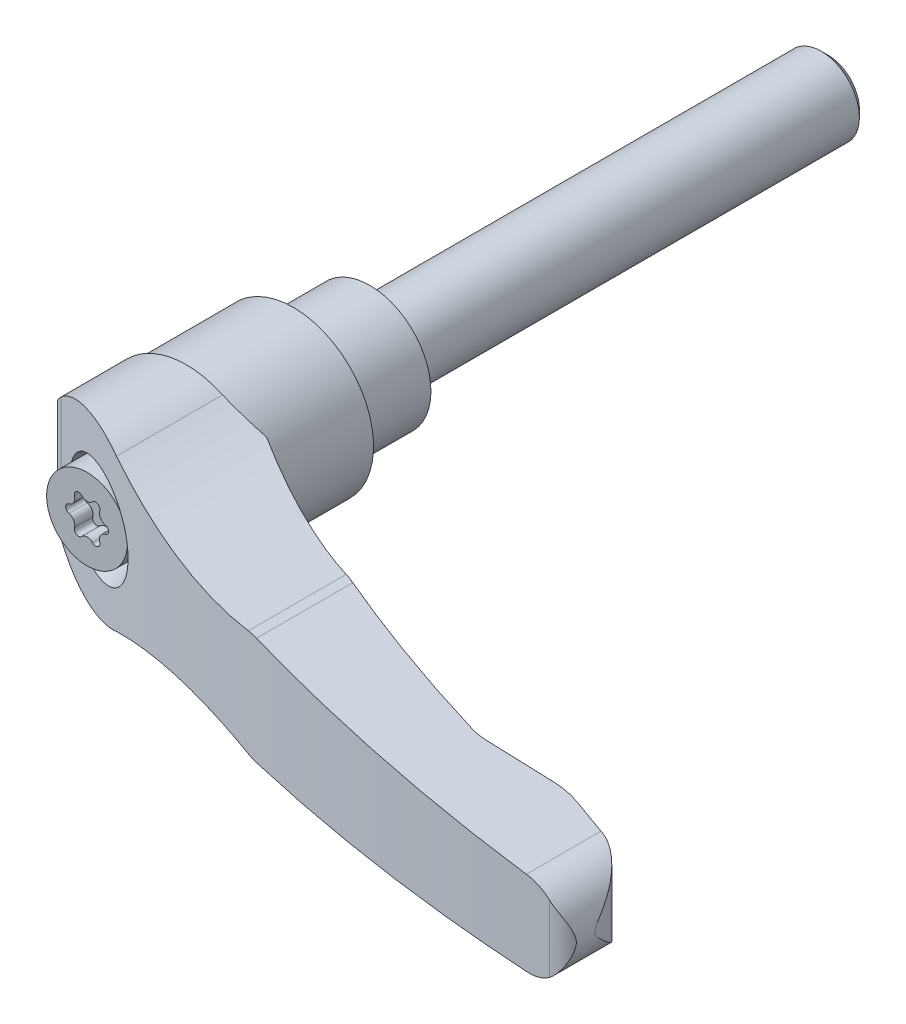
ISO-10303-21;
HEADER;
FILE_DESCRIPTION(('STEP AP214'),'2;1');
FILE_NAME('part.step','',(''),(''),'','','');
FILE_SCHEMA(('AUTOMOTIVE_DESIGN { 1 0 10303 214 1 1 1 1 }'));
ENDSEC;
DATA;
#1=APPLICATION_CONTEXT('core data for automotive mechanical design processes');
#2=APPLICATION_PROTOCOL_DEFINITION('international standard','automotive_design',2000,#1);
#3=PRODUCT_CONTEXT('',#1,'mechanical');
#4=PRODUCT('Part','Part','',(#3));
#5=PRODUCT_RELATED_PRODUCT_CATEGORY('part','',(#4));
#6=PRODUCT_DEFINITION_FORMATION('','',#4);
#7=PRODUCT_DEFINITION_CONTEXT('part definition',#1,'design');
#8=PRODUCT_DEFINITION('design','',#6,#7);
#9=PRODUCT_DEFINITION_SHAPE('','',#8);
#10=(LENGTH_UNIT() NAMED_UNIT(*) SI_UNIT(.MILLI.,.METRE.));
#11=(NAMED_UNIT(*) PLANE_ANGLE_UNIT() SI_UNIT($,.RADIAN.));
#12=(NAMED_UNIT(*) SI_UNIT($,.STERADIAN.) SOLID_ANGLE_UNIT());
#13=UNCERTAINTY_MEASURE_WITH_UNIT(LENGTH_MEASURE(1.E-05),#10,'distance_accuracy_value','');
#14=(GEOMETRIC_REPRESENTATION_CONTEXT(3) GLOBAL_UNCERTAINTY_ASSIGNED_CONTEXT((#13)) GLOBAL_UNIT_ASSIGNED_CONTEXT((#10,
#11,#12)) REPRESENTATION_CONTEXT('',''));
#15=CARTESIAN_POINT('',(0.,0.,0.));
#16=DIRECTION('',(0.,0.,1.));
#17=DIRECTION('',(1.,0.,0.));
#18=AXIS2_PLACEMENT_3D('',#15,#16,#17);
#19=CARTESIAN_POINT('',(0.,0.,-9.53924875));
#20=DIRECTION('',(0.,0.,-1.));
#21=DIRECTION('',(0.,1.,0.));
#22=AXIS2_PLACEMENT_3D('',#19,#20,#21);
#23=CYLINDRICAL_SURFACE('',#22,5.);
#24=CARTESIAN_POINT('',(0.,0.,-59.08));
#25=DIRECTION('',(0.,0.,-1.));
#26=DIRECTION('',(0.,1.,0.));
#27=AXIS2_PLACEMENT_3D('',#24,#25,#26);
#28=CIRCLE('',#27,5.);
#29=CARTESIAN_POINT('',(0.,5.,-59.08));
#30=VERTEX_POINT('',#29);
#31=EDGE_CURVE('E9',#30,#30,#28,.F.);
#32=ORIENTED_EDGE('',*,*,#31,.T.);
#33=EDGE_LOOP('',(#32));
#34=FACE_BOUND('',#33,.T.);
#35=CARTESIAN_POINT('',(0.,0.,0.));
#36=DIRECTION('',(0.,0.,-1.));
#37=DIRECTION('',(0.,1.,0.));
#38=AXIS2_PLACEMENT_3D('',#35,#36,#37);
#39=CIRCLE('',#38,5.);
#40=CARTESIAN_POINT('',(0.,5.,0.));
#41=VERTEX_POINT('',#40);
#42=EDGE_CURVE('E616',#41,#41,#39,.F.);
#43=ORIENTED_EDGE('',*,*,#42,.F.);
#44=EDGE_LOOP('',(#43));
#45=FACE_BOUND('',#44,.T.);
#46=ADVANCED_FACE('F14',(#34,#45),#23,.T.);
#47=CARTESIAN_POINT('',(6.5,0.,0.));
#48=DIRECTION('',(0.,0.,-1.));
#49=DIRECTION('',(0.,1.,0.));
#50=AXIS2_PLACEMENT_3D('',#47,#48,#49);
#51=PLANE('',#50);
#52=ORIENTED_EDGE('',*,*,#42,.T.);
#53=EDGE_LOOP('',(#52));
#54=FACE_BOUND('',#53,.T.);
#55=CARTESIAN_POINT('',(0.,0.,0.));
#56=DIRECTION('',(0.,0.,-1.));
#57=DIRECTION('',(0.,1.,0.));
#58=AXIS2_PLACEMENT_3D('',#55,#56,#57);
#59=CIRCLE('',#58,8.);
#60=CARTESIAN_POINT('',(0.,8.,0.));
#61=VERTEX_POINT('',#60);
#62=EDGE_CURVE('E699',#61,#61,#59,.F.);
#63=ORIENTED_EDGE('',*,*,#62,.F.);
#64=EDGE_LOOP('',(#63));
#65=FACE_BOUND('',#64,.T.);
#66=ADVANCED_FACE('F496',(#54,#65),#51,.T.);
#67=CARTESIAN_POINT('',(0.,0.,11.15));
#68=DIRECTION('',(0.,0.,-1.));
#69=DIRECTION('',(0.,1.,0.));
#70=AXIS2_PLACEMENT_3D('',#67,#68,#69);
#71=CYLINDRICAL_SURFACE('',#70,8.);
#72=ORIENTED_EDGE('',*,*,#62,.T.);
#73=EDGE_LOOP('',(#72));
#74=FACE_BOUND('',#73,.T.);
#75=CARTESIAN_POINT('',(0.,0.,10.7));
#76=DIRECTION('',(0.,0.,-1.));
#77=DIRECTION('',(1.,0.,0.));
#78=AXIS2_PLACEMENT_3D('',#75,#76,#77);
#79=CIRCLE('',#78,8.);
#80=CARTESIAN_POINT('',(8.,0.,10.7));
#81=VERTEX_POINT('',#80);
#82=EDGE_CURVE('E609',#81,#81,#79,.T.);
#83=ORIENTED_EDGE('',*,*,#82,.T.);
#84=EDGE_LOOP('',(#83));
#85=FACE_BOUND('',#84,.T.);
#86=ADVANCED_FACE('F487',(#74,#85),#71,.T.);
#87=CARTESIAN_POINT('',(0.,0.,10.4));
#88=DIRECTION('',(0.,0.,-1.));
#89=DIRECTION('',(0.,1.,0.));
#90=AXIS2_PLACEMENT_3D('',#87,#88,#89);
#91=CONICAL_SURFACE('',#90,8.3,0.785398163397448);
#92=ORIENTED_EDGE('',*,*,#82,.F.);
#93=EDGE_LOOP('',(#92));
#94=FACE_BOUND('',#93,.T.);
#95=CARTESIAN_POINT('',(0.,0.,10.4));
#96=DIRECTION('',(0.,0.,-1.));
#97=DIRECTION('',(0.,1.,0.));
#98=AXIS2_PLACEMENT_3D('',#95,#96,#97);
#99=CIRCLE('',#98,8.3);
#100=CARTESIAN_POINT('',(0.,8.3,10.4));
#101=VERTEX_POINT('',#100);
#102=EDGE_CURVE('E605',#101,#101,#99,.T.);
#103=ORIENTED_EDGE('',*,*,#102,.T.);
#104=EDGE_LOOP('',(#103));
#105=FACE_BOUND('',#104,.T.);
#106=ADVANCED_FACE('F483',(#94,#105),#91,.F.);
#107=CARTESIAN_POINT('',(0.,0.,9.7));
#108=DIRECTION('',(0.,0.,-1.));
#109=DIRECTION('',(0.,1.,0.));
#110=AXIS2_PLACEMENT_3D('',#107,#108,#109);
#111=CYLINDRICAL_SURFACE('',#110,8.3);
#112=ORIENTED_EDGE('',*,*,#102,.F.);
#113=EDGE_LOOP('',(#112));
#114=FACE_BOUND('',#113,.T.);
#115=CARTESIAN_POINT('',(0.,0.,10.));
#116=DIRECTION('',(0.,0.,-1.));
#117=DIRECTION('',(0.,1.,0.));
#118=AXIS2_PLACEMENT_3D('',#115,#116,#117);
#119=CIRCLE('',#118,8.3);
#120=CARTESIAN_POINT('',(0.,8.3,10.));
#121=VERTEX_POINT('',#120);
#122=EDGE_CURVE('E608',#121,#121,#119,.F.);
#123=ORIENTED_EDGE('',*,*,#122,.F.);
#124=EDGE_LOOP('',(#123));
#125=FACE_BOUND('',#124,.T.);
#126=ADVANCED_FACE('F479',(#114,#125),#111,.F.);
#127=CARTESIAN_POINT('',(-5.26,0.,10.));
#128=DIRECTION('',(0.,0.,-1.));
#129=DIRECTION('',(0.,1.,0.));
#130=AXIS2_PLACEMENT_3D('',#127,#128,#129);
#131=PLANE('',#130);
#132=CARTESIAN_POINT('',(-0.00999999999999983,0.,10.));
#133=DIRECTION('',(0.,0.,1.));
#134=DIRECTION('',(-1.,0.,0.));
#135=AXIS2_PLACEMENT_3D('',#132,#133,#134);
#136=CIRCLE('',#135,10.5);
#137=CARTESIAN_POINT('',(-10.2600377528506,-2.27743848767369,10.));
#138=VERTEX_POINT('',#137);
#139=CARTESIAN_POINT('',(-10.2600377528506,2.27743848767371,10.));
#140=VERTEX_POINT('',#139);
#141=EDGE_CURVE('E707',#138,#140,#136,.T.);
#142=ORIENTED_EDGE('',*,*,#141,.F.);
#143=DIRECTION('',(0.,-1.,0.));
#144=VECTOR('',#143,1.);
#145=CARTESIAN_POINT('',(-10.2600377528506,-22.,10.));
#146=LINE('',#145,#144);
#147=EDGE_CURVE('E706',#138,#140,#146,.F.);
#148=ORIENTED_EDGE('',*,*,#147,.T.);
#149=EDGE_LOOP('',(#142,#148));
#150=FACE_BOUND('',#149,.T.);
#151=ORIENTED_EDGE('',*,*,#122,.T.);
#152=EDGE_LOOP('',(#151));
#153=FACE_BOUND('',#152,.T.);
#154=ADVANCED_FACE('F475',(#150,#153),#131,.T.);
#155=CARTESIAN_POINT('',(-10.2600377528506,-22.,10.));
#156=DIRECTION('',(0.707106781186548,0.,0.707106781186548));
#157=DIRECTION('',(-0.707106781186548,0.,0.707106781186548));
#158=AXIS2_PLACEMENT_3D('',#155,#156,#157);
#159=PLANE('',#158);
#160=ORIENTED_EDGE('',*,*,#147,.F.);
#161=CARTESIAN_POINT('',(-0.00999999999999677,0.,-0.250037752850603));
#162=DIRECTION('',(0.707106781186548,0.,0.707106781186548));
#163=DIRECTION('',(-0.707106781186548,0.,0.707106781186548));
#164=AXIS2_PLACEMENT_3D('',#161,#162,#163);
#165=ELLIPSE('',#164,14.8492424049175,10.5);
#166=EDGE_CURVE('E709',#140,#138,#165,.T.);
#167=ORIENTED_EDGE('',*,*,#166,.F.);
#168=EDGE_LOOP('',(#160,#167));
#169=FACE_BOUND('',#168,.T.);
#170=ADVANCED_FACE('F471',(#169),#159,.F.);
#171=CARTESIAN_POINT('',(-0.0100000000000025,0.,18.90625));
#172=DIRECTION('',(0.,0.,1.));
#173=DIRECTION('',(-1.,0.,0.));
#174=AXIS2_PLACEMENT_3D('',#171,#172,#173);
#175=CYLINDRICAL_SURFACE('',#174,10.5);
#176=CARTESIAN_POINT('',(-0.010000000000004,0.,24.));
#177=DIRECTION('',(0.,0.,1.));
#178=DIRECTION('',(-1.,0.,0.));
#179=AXIS2_PLACEMENT_3D('',#176,#177,#178);
#180=CIRCLE('',#179,10.5);
#181=CARTESIAN_POINT('',(-10.51,0.,24.));
#182=VERTEX_POINT('',#181);
#183=CARTESIAN_POINT('',(10.49,0.,24.));
#184=VERTEX_POINT('',#183);
#185=EDGE_CURVE('E456',#182,#184,#180,.T.);
#186=ORIENTED_EDGE('',*,*,#185,.F.);
#187=CARTESIAN_POINT('',(-0.010000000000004,0.,24.));
#188=DIRECTION('',(0.,0.,1.));
#189=DIRECTION('',(-1.,0.,0.));
#190=AXIS2_PLACEMENT_3D('',#187,#188,#189);
#191=CIRCLE('',#190,10.5);
#192=EDGE_CURVE('E591',#184,#182,#191,.T.);
#193=ORIENTED_EDGE('',*,*,#192,.F.);
#194=EDGE_LOOP('',(#186,#193));
#195=FACE_BOUND('',#194,.T.);
#196=ORIENTED_EDGE('',*,*,#141,.T.);
#197=ORIENTED_EDGE('',*,*,#166,.T.);
#198=EDGE_LOOP('',(#196,#197));
#199=FACE_BOUND('',#198,.T.);
#200=ADVANCED_FACE('F467',(#195,#199),#175,.T.);
#201=CARTESIAN_POINT('',(-10.51,-12.,24.));
#202=DIRECTION('',(0.,0.,-1.));
#203=DIRECTION('',(0.,1.,0.));
#204=AXIS2_PLACEMENT_3D('',#201,#202,#203);
#205=PLANE('',#204);
#206=ORIENTED_EDGE('',*,*,#185,.T.);
#207=DIRECTION('',(0.,-1.,0.));
#208=VECTOR('',#207,1.);
#209=CARTESIAN_POINT('',(10.4900000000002,-12.,23.9999999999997));
#210=LINE('',#209,#208);
#211=CARTESIAN_POINT('',(10.4900000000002,-8.03465812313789,24.));
#212=VERTEX_POINT('',#211);
#213=EDGE_CURVE('E442',#184,#212,#210,.T.);
#214=ORIENTED_EDGE('',*,*,#213,.T.);
#215=CARTESIAN_POINT('',(22.94,-55.53,24.));
#216=DIRECTION('',(0.,0.,1.));
#217=DIRECTION('',(0.,-1.,0.));
#218=AXIS2_PLACEMENT_3D('',#215,#216,#217);
#219=CIRCLE('',#218,49.1);
#220=CARTESIAN_POINT('',(4.72251026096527,-9.93468151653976,24.));
#221=VERTEX_POINT('',#220);
#222=EDGE_CURVE('E746',#212,#221,#219,.T.);
#223=ORIENTED_EDGE('',*,*,#222,.T.);
#224=CARTESIAN_POINT('',(0.,0.,24.));
#225=DIRECTION('',(0.,0.,1.));
#226=DIRECTION('',(0.,-1.,0.));
#227=AXIS2_PLACEMENT_3D('',#224,#225,#226);
#228=CIRCLE('',#227,11.);
#229=CARTESIAN_POINT('',(-10.51,-3.24652121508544,24.));
#230=VERTEX_POINT('',#229);
#231=EDGE_CURVE('E740',#230,#221,#228,.T.);
#232=ORIENTED_EDGE('',*,*,#231,.F.);
#233=DIRECTION('',(0.,-1.,0.));
#234=VECTOR('',#233,1.);
#235=CARTESIAN_POINT('',(-10.51,-12.,24.));
#236=LINE('',#235,#234);
#237=EDGE_CURVE('E590',#182,#230,#236,.T.);
#238=ORIENTED_EDGE('',*,*,#237,.F.);
#239=EDGE_LOOP('',(#206,#214,#223,#232,#238));
#240=FACE_BOUND('',#239,.T.);
#241=ADVANCED_FACE('F462',(#240),#205,.T.);
#242=CARTESIAN_POINT('',(31.3589689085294,0.945932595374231,54.5));
#243=DIRECTION('',(0.,0.,1.));
#244=DIRECTION('',(0.,-1.,0.));
#245=AXIS2_PLACEMENT_3D('',#242,#243,#244);
#246=CYLINDRICAL_SURFACE('',#245,8.00000000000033);
#247=CARTESIAN_POINT('',(31.6479325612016,-7.04884695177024,46.4731806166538));
#248=CARTESIAN_POINT('',(31.4018180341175,-7.05768532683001,46.4087993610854));
#249=CARTESIAN_POINT('',(31.1563854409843,-7.05525330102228,46.3442255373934));
#250=CARTESIAN_POINT('',(30.66688412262,-7.02784844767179,46.2146927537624));
#251=CARTESIAN_POINT('',(30.4228153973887,-7.00287562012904,46.1497337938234));
#252=CARTESIAN_POINT('',(30.1794286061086,-6.96663239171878,46.0845822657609));
#253=B_SPLINE_CURVE_WITH_KNOTS('',3,(#247,#248,#249,#250,#251,#252),.UNSPECIFIED.,.F.,.F.,(4,2,
4),(0.,0.76139061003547,1.52278122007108),.UNSPECIFIED.);
#254=CARTESIAN_POINT('',(31.6479325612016,-7.04884695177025,46.4731806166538));
#255=VERTEX_POINT('',#254);
#256=CARTESIAN_POINT('',(30.1794286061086,-6.96663239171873,46.084582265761));
#257=VERTEX_POINT('',#256);
#258=EDGE_CURVE('E449',#255,#257,#253,.T.);
#259=ORIENTED_EDGE('',*,*,#258,.T.);
#260=DIRECTION('',(0.,0.,1.));
#261=VECTOR('',#260,1.);
#262=CARTESIAN_POINT('',(30.1794286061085,-6.96663239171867,54.5));
#263=LINE('',#262,#261);
#264=CARTESIAN_POINT('',(30.1794286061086,-6.96663239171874,33.2732494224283));
#265=VERTEX_POINT('',#264);
#266=EDGE_CURVE('E741',#257,#265,#263,.F.);
#267=ORIENTED_EDGE('',*,*,#266,.T.);
#268=CARTESIAN_POINT('',(30.1794286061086,-6.9666323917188,33.2732494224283));
#269=CARTESIAN_POINT('',(30.4222007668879,-7.00282816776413,33.3728739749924));
#270=CARTESIAN_POINT('',(30.6665043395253,-7.02781937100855,33.4725985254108));
#271=CARTESIAN_POINT('',(31.0339219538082,-7.04840105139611,33.6217860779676));
#272=CARTESIAN_POINT('',(31.1565128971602,-7.05244559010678,33.6714318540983));
#273=CARTESIAN_POINT('',(31.4020580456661,-7.05489552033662,33.7706062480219));
#274=CARTESIAN_POINT('',(31.5250125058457,-7.05329063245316,33.8201344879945));
#275=CARTESIAN_POINT('',(31.6479325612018,-7.04884695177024,33.8695155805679));
#276=B_SPLINE_CURVE_WITH_KNOTS('',3,(#268,#269,#270,#271,#272,#273,#274,#275),.UNSPECIFIED.,.F.,
.F.,(4,2,2,4),(0.,0.794258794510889,1.19111760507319,1.58869889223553),.UNSPECIFIED.);
#277=CARTESIAN_POINT('',(31.6479325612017,-7.04884695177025,33.8695155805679));
#278=VERTEX_POINT('',#277);
#279=EDGE_CURVE('E444',#265,#278,#276,.T.);
#280=ORIENTED_EDGE('',*,*,#279,.T.);
#281=DIRECTION('',(0.,0.,1.));
#282=VECTOR('',#281,1.);
#283=CARTESIAN_POINT('',(31.6479325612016,-7.04884695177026,54.5));
#284=LINE('',#283,#282);
#285=EDGE_CURVE('E751',#278,#255,#284,.T.);
#286=ORIENTED_EDGE('',*,*,#285,.T.);
#287=EDGE_LOOP('',(#259,#267,#280,#286));
#288=FACE_BOUND('',#287,.T.);
#289=ADVANCED_FACE('F458',(#288),#246,.T.);
#290=CARTESIAN_POINT('',(79.9967051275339,-12.,50.5395921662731));
#291=DIRECTION('',(0.992331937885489,0.,-0.123601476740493));
#292=DIRECTION('',(0.123601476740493,0.,0.992331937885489));
#293=AXIS2_PLACEMENT_3D('',#290,#291,#292);
#294=PLANE('',#293);
#295=CARTESIAN_POINT('',(79.9967051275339,-0.190348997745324,50.5395921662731));
#296=CARTESIAN_POINT('',(79.9969785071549,-0.182455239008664,50.5417867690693));
#297=CARTESIAN_POINT('',(79.9972360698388,-0.174525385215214,50.543854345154));
#298=CARTESIAN_POINT('',(79.9977166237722,-0.158664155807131,50.5477118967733));
#299=CARTESIAN_POINT('',(79.9979398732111,-0.150733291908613,50.5495039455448));
#300=CARTESIAN_POINT('',(79.9983518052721,-0.134870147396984,50.5528105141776));
#301=CARTESIAN_POINT('',(79.998540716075,-0.12693825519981,50.5543268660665));
#302=CARTESIAN_POINT('',(79.9988840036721,-0.111073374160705,50.5570823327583));
#303=CARTESIAN_POINT('',(79.9990385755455,-0.103140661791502,50.5583230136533));
#304=CARTESIAN_POINT('',(79.9993132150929,-0.087274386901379,50.5605274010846));
#305=CARTESIAN_POINT('',(79.9994334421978,-0.0793410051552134,50.5614923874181));
#306=CARTESIAN_POINT('',(79.9996394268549,-0.0634736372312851,50.5631456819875));
#307=CARTESIAN_POINT('',(79.9997253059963,-0.0555397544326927,50.5638349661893));
#308=CARTESIAN_POINT('',(79.9998626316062,-0.0396716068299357,50.5649371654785));
#309=CARTESIAN_POINT('',(79.9999141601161,-0.0317373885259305,50.5653507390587));
#310=CARTESIAN_POINT('',(79.9999828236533,-0.0158687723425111,50.5659018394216));
#311=CARTESIAN_POINT('',(80.,-0.00793438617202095,50.5660396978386));
#312=CARTESIAN_POINT('',(80.,0.00793438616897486,50.5660396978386));
#313=CARTESIAN_POINT('',(79.9999828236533,0.0158687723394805,50.5659018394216));
#314=CARTESIAN_POINT('',(79.9999141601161,0.0317373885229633,50.5653507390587));
#315=CARTESIAN_POINT('',(79.9998626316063,0.0396716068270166,50.5649371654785));
#316=CARTESIAN_POINT('',(79.9997253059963,0.0555397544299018,50.5638349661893));
#317=CARTESIAN_POINT('',(79.9996394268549,0.0634736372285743,50.5631456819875));
#318=CARTESIAN_POINT('',(79.9994334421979,0.0793410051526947,50.5614923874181));
#319=CARTESIAN_POINT('',(79.9993132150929,0.0872743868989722,50.5605274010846));
#320=CARTESIAN_POINT('',(79.9990385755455,0.103140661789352,50.5583230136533));
#321=CARTESIAN_POINT('',(79.9988840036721,0.111073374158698,50.5570823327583));
#322=CARTESIAN_POINT('',(79.998540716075,0.126938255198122,50.5543268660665));
#323=CARTESIAN_POINT('',(79.9983518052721,0.134870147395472,50.5528105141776));
#324=CARTESIAN_POINT('',(79.9979398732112,0.150733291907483,50.5495039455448));
#325=CARTESIAN_POINT('',(79.9977166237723,0.158664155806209,50.5477118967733));
#326=CARTESIAN_POINT('',(79.9972360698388,0.174525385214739,50.543854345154));
#327=CARTESIAN_POINT('',(79.9969785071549,0.182455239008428,50.5417867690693));
#328=CARTESIAN_POINT('',(79.9967051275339,0.190348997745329,50.5395921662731));
#329=B_SPLINE_CURVE_WITH_KNOTS('',3,(#295,#296,#297,#298,#299,#300,#301,#302,#303,#304,#305,
#306,#307,#308,#309,#310,#311,#312,#313,#314,#315,#316,#317,#318,#319,#320,#321,#322,#323,#324,
#325,#326,#327,#328),.UNSPECIFIED.,.F.,.F.,(4,2,2,2,2,2,2,2,2,2,2,2,2,2,2,2,4),(0.,
0.0245923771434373,0.0489895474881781,0.0732181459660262,0.0973053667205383,0.121278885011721,
0.145166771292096,0.168997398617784,0.19279934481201,0.216601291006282,0.240431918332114,
0.264319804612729,0.288293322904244,0.312380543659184,0.336609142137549,0.361006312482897,
0.385598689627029),.UNSPECIFIED.);
#330=CARTESIAN_POINT('',(79.9967051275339,-0.190348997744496,50.5395921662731));
#331=VERTEX_POINT('',#330);
#332=CARTESIAN_POINT('',(79.9967051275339,0.190348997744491,50.5395921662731));
#333=VERTEX_POINT('',#332);
#334=EDGE_CURVE('E370',#331,#333,#329,.T.);
#335=ORIENTED_EDGE('',*,*,#334,.F.);
#336=DIRECTION('',(0.,-1.,0.));
#337=VECTOR('',#336,1.);
#338=CARTESIAN_POINT('',(79.9967051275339,-12.,50.5395921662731));
#339=LINE('',#338,#337);
#340=EDGE_CURVE('E455',#333,#331,#339,.T.);
#341=ORIENTED_EDGE('',*,*,#340,.F.);
#342=EDGE_LOOP('',(#335,#341));
#343=FACE_BOUND('',#342,.T.);
#344=ADVANCED_FACE('F399',(#343),#294,.T.);
#345=CARTESIAN_POINT('',(72.6137555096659,-12.,51.4591871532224));
#346=DIRECTION('',(0.,-1.,0.));
#347=DIRECTION('',(1.,0.,0.));
#348=AXIS2_PLACEMENT_3D('',#345,#346,#347);
#349=CYLINDRICAL_SURFACE('',#348,7.44);
#350=CARTESIAN_POINT('',(79.9967051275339,0.190348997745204,50.5395921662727));
#351=CARTESIAN_POINT('',(79.9951469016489,0.235214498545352,50.5270575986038));
#352=CARTESIAN_POINT('',(79.9930953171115,0.27873685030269,50.5108629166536));
#353=CARTESIAN_POINT('',(79.988164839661,0.363077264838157,50.4732708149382));
#354=CARTESIAN_POINT('',(79.9852922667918,0.40391316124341,50.4519133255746));
#355=CARTESIAN_POINT('',(79.975702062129,0.52245816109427,50.3833482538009));
#356=CARTESIAN_POINT('',(79.9679715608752,0.597169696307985,50.3312876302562));
#357=CARTESIAN_POINT('',(79.9508869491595,0.736456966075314,50.2251559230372));
#358=CARTESIAN_POINT('',(79.9416856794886,0.801375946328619,50.1714851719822));
#359=CARTESIAN_POINT('',(79.9214540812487,0.928420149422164,50.0612288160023));
#360=CARTESIAN_POINT('',(79.9104232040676,0.990544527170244,50.0046423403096));
#361=CARTESIAN_POINT('',(79.8746515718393,1.17419942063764,49.8323129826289));
#362=CARTESIAN_POINT('',(79.8472488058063,1.29287988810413,49.7141099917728));
#363=CARTESIAN_POINT('',(79.7848398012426,1.52823594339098,49.4729704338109));
#364=CARTESIAN_POINT('',(79.7496926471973,1.64482416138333,49.3499864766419));
#365=CARTESIAN_POINT('',(79.6721004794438,1.87458318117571,49.1033284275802));
#366=CARTESIAN_POINT('',(79.6296610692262,1.98775652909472,48.9796549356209));
#367=CARTESIAN_POINT('',(79.5033816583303,2.29352791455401,48.6415502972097));
#368=CARTESIAN_POINT('',(79.4120558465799,2.48329449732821,48.427296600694));
#369=CARTESIAN_POINT('',(79.2061355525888,2.85434488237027,48.0023120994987));
#370=CARTESIAN_POINT('',(79.0915236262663,3.03562219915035,47.7915840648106));
#371=CARTESIAN_POINT('',(78.8390032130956,3.38665877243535,47.3777391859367));
#372=CARTESIAN_POINT('',(78.7012752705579,3.5564939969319,47.1745772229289));
#373=CARTESIAN_POINT('',(78.4009143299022,3.88356808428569,46.7768350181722));
#374=CARTESIAN_POINT('',(78.2383021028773,4.04081728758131,46.5822477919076));
#375=CARTESIAN_POINT('',(77.9568022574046,4.2801698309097,46.2794503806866));
#376=CARTESIAN_POINT('',(77.8461272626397,4.36735584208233,46.1675710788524));
#377=CARTESIAN_POINT('',(77.61512986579,4.53501217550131,45.9487274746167));
#378=CARTESIAN_POINT('',(77.494805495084,4.61548112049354,45.8417641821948));
#379=CARTESIAN_POINT('',(77.2447591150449,4.7684092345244,45.6339165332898));
#380=CARTESIAN_POINT('',(77.1150589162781,4.84088606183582,45.5330190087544));
#381=CARTESIAN_POINT('',(76.8461728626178,4.97676025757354,45.3380932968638));
#382=CARTESIAN_POINT('',(76.7069926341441,5.04016294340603,45.2440611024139));
#383=CARTESIAN_POINT('',(76.4438690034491,5.14664435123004,45.0792448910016));
#384=CARTESIAN_POINT('',(76.3213555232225,5.19134589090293,45.0072256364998));
#385=CARTESIAN_POINT('',(76.0703754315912,5.27269544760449,44.8693561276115));
#386=CARTESIAN_POINT('',(75.9419112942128,5.30934677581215,44.8035033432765));
#387=CARTESIAN_POINT('',(75.678496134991,5.37397975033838,44.6781572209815));
#388=CARTESIAN_POINT('',(75.5435027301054,5.40189236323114,44.6187168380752));
#389=CARTESIAN_POINT('',(75.2686009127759,5.44782102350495,44.507386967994));
#390=CARTESIAN_POINT('',(75.1286862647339,5.46582399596,44.4555075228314));
#391=CARTESIAN_POINT('',(74.9868127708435,5.47841339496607,44.407790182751));
#392=B_SPLINE_CURVE_WITH_KNOTS('',3,(#350,#351,#352,#353,#354,#355,#356,#357,#358,#359,#360,
#361,#362,#363,#364,#365,#366,#367,#368,#369,#370,#371,#372,#373,#374,#375,#376,#377,#378,#379,
#380,#381,#382,#383,#384,#385,#386,#387,#388,#389,#390,#391),.UNSPECIFIED.,.F.,.F.,(4,2,2,2,2,2,
2,2,2,2,2,2,2,2,2,2,2,2,2,2,4),(0.,0.139245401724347,0.277446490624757,0.550810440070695,
0.804906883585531,1.05907965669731,1.56794086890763,2.08696422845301,2.60559053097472,
3.50582150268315,4.40672935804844,5.30090298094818,6.1943342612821,6.73367946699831,
7.27313498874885,7.81137365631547,8.3492956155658,8.79580649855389,9.24213337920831,
9.69190199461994,10.1422626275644),.UNSPECIFIED.);
#393=CARTESIAN_POINT('',(74.9868127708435,5.47841339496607,44.407790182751));
#394=VERTEX_POINT('',#393);
#395=EDGE_CURVE('E387',#333,#394,#392,.T.);
#396=ORIENTED_EDGE('',*,*,#395,.F.);
#397=ORIENTED_EDGE('',*,*,#340,.T.);
#398=CARTESIAN_POINT('',(74.9868127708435,-5.47841339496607,44.407790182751));
#399=CARTESIAN_POINT('',(75.1398120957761,-5.46484028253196,44.459242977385));
#400=CARTESIAN_POINT('',(75.2905169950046,-5.44496899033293,44.5155387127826));
#401=CARTESIAN_POINT('',(75.5860882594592,-5.39377415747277,44.6368581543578));
#402=CARTESIAN_POINT('',(75.7309637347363,-5.36246932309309,44.7018674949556));
#403=CARTESIAN_POINT('',(76.0125967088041,-5.28989557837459,44.8390817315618));
#404=CARTESIAN_POINT('',(76.1494251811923,-5.24873835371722,44.9112009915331));
#405=CARTESIAN_POINT('',(76.4161065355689,-5.15736483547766,45.0623731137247));
#406=CARTESIAN_POINT('',(76.5459558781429,-5.10714400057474,45.1414294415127));
#407=CARTESIAN_POINT('',(76.8276536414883,-4.98604991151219,45.3247681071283));
#408=CARTESIAN_POINT('',(76.9775772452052,-4.91309116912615,45.4306358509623));
#409=CARTESIAN_POINT('',(77.265789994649,-4.75681575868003,45.6501400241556));
#410=CARTESIAN_POINT('',(77.4040776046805,-4.67349772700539,45.7637774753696));
#411=CARTESIAN_POINT('',(77.8028296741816,-4.40945601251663,46.1156758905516));
#412=CARTESIAN_POINT('',(78.0457801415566,-4.21527563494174,46.3639882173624));
#413=CARTESIAN_POINT('',(78.417694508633,-3.86589184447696,46.7984433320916));
#414=CARTESIAN_POINT('',(78.5586476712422,-3.71726415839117,46.9799982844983));
#415=CARTESIAN_POINT('',(78.8199419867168,-3.41009407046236,47.3496806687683));
#416=CARTESIAN_POINT('',(78.940273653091,-3.25154715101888,47.537811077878));
#417=CARTESIAN_POINT('',(79.1607378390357,-2.92676895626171,47.9181651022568));
#418=CARTESIAN_POINT('',(79.2609186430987,-2.76055725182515,48.1103776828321));
#419=CARTESIAN_POINT('',(79.4421677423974,-2.42115236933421,48.4974286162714));
#420=CARTESIAN_POINT('',(79.5232445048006,-2.24796232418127,48.692265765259));
#421=CARTESIAN_POINT('',(79.6578968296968,-1.91676087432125,49.0578102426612));
#422=CARTESIAN_POINT('',(79.7136489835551,-1.75958096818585,49.2284695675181));
#423=CARTESIAN_POINT('',(79.786963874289,-1.51825146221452,49.4826945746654));
#424=CARTESIAN_POINT('',(79.8097141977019,-1.43673320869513,49.567289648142));
#425=CARTESIAN_POINT('',(79.8517302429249,-1.27132927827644,49.7350141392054));
#426=CARTESIAN_POINT('',(79.870996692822,-1.18744410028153,49.8181438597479));
#427=CARTESIAN_POINT('',(79.9071865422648,-1.01046435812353,49.9869732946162));
#428=CARTESIAN_POINT('',(79.9238666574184,-0.917129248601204,50.0724723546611));
#429=CARTESIAN_POINT('',(79.9529450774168,-0.724505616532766,50.2358460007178));
#430=CARTESIAN_POINT('',(79.9653823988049,-0.625281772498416,50.3137850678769));
#431=CARTESIAN_POINT('',(79.9802376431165,-0.468580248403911,50.4153149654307));
#432=CARTESIAN_POINT('',(79.9845030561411,-0.416215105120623,50.4460963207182));
#433=CARTESIAN_POINT('',(79.9917045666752,-0.30687937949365,50.4998809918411));
#434=CARTESIAN_POINT('',(79.9946243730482,-0.249861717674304,50.5227881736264));
#435=CARTESIAN_POINT('',(79.9967051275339,-0.190348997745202,50.5395921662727));
#436=B_SPLINE_CURVE_WITH_KNOTS('',3,(#398,#399,#400,#401,#402,#403,#404,#405,#406,#407,#408,
#409,#410,#411,#412,#413,#414,#415,#416,#417,#418,#419,#420,#421,#422,#423,#424,#425,#426,#427,
#428,#429,#430,#431,#432,#433,#434,#435),.UNSPECIFIED.,.F.,.F.,(4,2,2,2,2,2,2,2,2,2,2,2,2,2,2,2,
2,2,4),(0.,0.485611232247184,0.970431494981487,1.44999646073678,1.92980238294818,
2.52141817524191,3.11311192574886,4.30183389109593,5.12208341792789,5.94270927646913,
6.76134473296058,7.57961667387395,8.29494630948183,8.65387747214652,9.01273353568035,
9.39561932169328,9.77488268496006,9.95698827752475,10.141244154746),.UNSPECIFIED.);
#437=CARTESIAN_POINT('',(74.9868127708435,-5.47841339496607,44.407790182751));
#438=VERTEX_POINT('',#437);
#439=EDGE_CURVE('E359',#438,#331,#436,.T.);
#440=ORIENTED_EDGE('',*,*,#439,.F.);
#441=DIRECTION('',(0.,-1.,0.));
#442=VECTOR('',#441,1.);
#443=CARTESIAN_POINT('',(74.9868127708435,-12.,44.407790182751));
#444=LINE('',#443,#442);
#445=EDGE_CURVE('E443',#394,#438,#444,.T.);
#446=ORIENTED_EDGE('',*,*,#445,.F.);
#447=EDGE_LOOP('',(#396,#397,#440,#446));
#448=FACE_BOUND('',#447,.T.);
#449=ADVANCED_FACE('F393',(#448),#349,.T.);
#450=CARTESIAN_POINT('',(57.3760512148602,-12.,33.47));
#451=DIRECTION('',(0.,-1.,0.));
#452=DIRECTION('',(1.,0.,0.));
#453=AXIS2_PLACEMENT_3D('',#450,#451,#452);
#454=CYLINDRICAL_SURFACE('',#453,8.58999999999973);
#455=DIRECTION('',(0.,-1.,0.));
#456=VECTOR('',#455,1.);
#457=CARTESIAN_POINT('',(55.1138126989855,-12.,41.756759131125));
#458=LINE('',#457,#456);
#459=CARTESIAN_POINT('',(55.1138126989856,-6.20069518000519,41.7567591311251));
#460=VERTEX_POINT('',#459);
#461=CARTESIAN_POINT('',(55.1138126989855,6.2006951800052,41.7567591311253));
#462=VERTEX_POINT('',#461);
#463=EDGE_CURVE('E735',#460,#462,#458,.F.);
#464=ORIENTED_EDGE('',*,*,#463,.T.);
#465=CARTESIAN_POINT('',(57.3760512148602,6.11892873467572,33.47));
#466=DIRECTION('',(-0.0361204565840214,-0.999347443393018,0.));
#467=DIRECTION('',(0.999347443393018,-0.0361204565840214,0.));
#468=AXIS2_PLACEMENT_3D('',#465,#466,#467);
#469=ELLIPSE('',#468,8.59560912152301,8.58999999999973);
#470=CARTESIAN_POINT('',(57.3760512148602,6.11892873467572,42.06));
#471=VERTEX_POINT('',#470);
#472=EDGE_CURVE('E816',#462,#471,#469,.F.);
#473=ORIENTED_EDGE('',*,*,#472,.T.);
#474=DIRECTION('',(0.,1.,0.));
#475=VECTOR('',#474,1.);
#476=CARTESIAN_POINT('',(57.3760512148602,-12.,42.06));
#477=LINE('',#476,#475);
#478=CARTESIAN_POINT('',(57.3760512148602,-6.11892873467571,42.06));
#479=VERTEX_POINT('',#478);
#480=EDGE_CURVE('E596',#479,#471,#477,.T.);
#481=ORIENTED_EDGE('',*,*,#480,.F.);
#482=CARTESIAN_POINT('',(57.3760512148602,-6.11892873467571,33.47));
#483=DIRECTION('',(-0.0361204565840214,0.999347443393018,0.));
#484=DIRECTION('',(-0.999347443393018,-0.0361204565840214,0.));
#485=AXIS2_PLACEMENT_3D('',#482,#483,#484);
#486=ELLIPSE('',#485,8.59560912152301,8.58999999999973);
#487=EDGE_CURVE('E756',#479,#460,#486,.F.);
#488=ORIENTED_EDGE('',*,*,#487,.T.);
#489=EDGE_LOOP('',(#464,#473,#481,#488));
#490=FACE_BOUND('',#489,.T.);
#491=ADVANCED_FACE('F398',(#490),#454,.F.);
#492=CARTESIAN_POINT('',(57.3760512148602,-12.,42.06));
#493=DIRECTION('',(0.,0.,-1.));
#494=DIRECTION('',(0.,1.,0.));
#495=AXIS2_PLACEMENT_3D('',#492,#493,#494);
#496=PLANE('',#495);
#497=DIRECTION('',(0.999347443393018,-0.0361204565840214,0.));
#498=VECTOR('',#497,1.);
#499=CARTESIAN_POINT('',(31.6479325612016,7.04884695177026,42.06));
#500=LINE('',#499,#498);
#501=CARTESIAN_POINT('',(66.1633245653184,5.80132115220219,42.06));
#502=VERTEX_POINT('',#501);
#503=EDGE_CURVE('E813',#471,#502,#500,.T.);
#504=ORIENTED_EDGE('',*,*,#503,.T.);
#505=DIRECTION('',(0.,-1.,0.));
#506=VECTOR('',#505,1.);
#507=CARTESIAN_POINT('',(66.1633245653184,-12.,42.06));
#508=LINE('',#507,#506);
#509=CARTESIAN_POINT('',(66.1633245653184,-5.80132115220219,42.06));
#510=VERTEX_POINT('',#509);
#511=EDGE_CURVE('E595',#510,#502,#508,.F.);
#512=ORIENTED_EDGE('',*,*,#511,.F.);
#513=DIRECTION('',(-0.999347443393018,-0.0361204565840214,0.));
#514=VECTOR('',#513,1.);
#515=CARTESIAN_POINT('',(74.5,-5.5,42.06));
#516=LINE('',#515,#514);
#517=EDGE_CURVE('E754',#510,#479,#516,.T.);
#518=ORIENTED_EDGE('',*,*,#517,.T.);
#519=ORIENTED_EDGE('',*,*,#480,.T.);
#520=EDGE_LOOP('',(#504,#512,#518,#519));
#521=FACE_BOUND('',#520,.T.);
#522=ADVANCED_FACE('F405',(#521),#496,.T.);
#523=CARTESIAN_POINT('',(66.1633245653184,-12.,53.34));
#524=DIRECTION('',(0.,-1.,0.));
#525=DIRECTION('',(1.,0.,0.));
#526=AXIS2_PLACEMENT_3D('',#523,#524,#525);
#527=CYLINDRICAL_SURFACE('',#526,11.2800000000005);
#528=CARTESIAN_POINT('',(66.1633245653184,5.80132115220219,53.34));
#529=DIRECTION('',(-0.0361204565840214,-0.999347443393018,0.));
#530=DIRECTION('',(0.999347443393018,-0.0361204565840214,0.));
#531=AXIS2_PLACEMENT_3D('',#528,#529,#530);
#532=ELLIPSE('',#531,11.2873656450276,11.2800000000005);
#533=CARTESIAN_POINT('',(69.7611855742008,5.6712799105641,42.6491723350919));
#534=VERTEX_POINT('',#533);
#535=EDGE_CURVE('E815',#502,#534,#532,.T.);
#536=ORIENTED_EDGE('',*,*,#535,.T.);
#537=DIRECTION('',(0.,-1.,0.));
#538=VECTOR('',#537,1.);
#539=CARTESIAN_POINT('',(69.7611855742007,-12.,42.6491723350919));
#540=LINE('',#539,#538);
#541=CARTESIAN_POINT('',(69.7611855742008,-5.6712799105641,42.6491723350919));
#542=VERTEX_POINT('',#541);
#543=EDGE_CURVE('E592',#542,#534,#540,.F.);
#544=ORIENTED_EDGE('',*,*,#543,.F.);
#545=CARTESIAN_POINT('',(66.1633245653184,-5.80132115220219,53.34));
#546=DIRECTION('',(-0.0361204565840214,0.999347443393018,0.));
#547=DIRECTION('',(-0.999347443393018,-0.0361204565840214,0.));
#548=AXIS2_PLACEMENT_3D('',#545,#546,#547);
#549=ELLIPSE('',#548,11.2873656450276,11.2800000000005);
#550=EDGE_CURVE('E757',#542,#510,#549,.T.);
#551=ORIENTED_EDGE('',*,*,#550,.T.);
#552=ORIENTED_EDGE('',*,*,#511,.T.);
#553=EDGE_LOOP('',(#536,#544,#551,#552));
#554=FACE_BOUND('',#553,.T.);
#555=ADVANCED_FACE('F409',(#554),#527,.T.);
#556=CARTESIAN_POINT('',(69.7611855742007,-12.,42.6491723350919));
#557=DIRECTION('',(0.318959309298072,0.,-0.947768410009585));
#558=DIRECTION('',(0.947768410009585,0.,0.318959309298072));
#559=AXIS2_PLACEMENT_3D('',#556,#557,#558);
#560=PLANE('',#559);
#561=ORIENTED_EDGE('',*,*,#445,.T.);
#562=CARTESIAN_POINT('',(74.5,0.,44.2439595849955));
#563=DIRECTION('',(0.318959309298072,0.,-0.947768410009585));
#564=DIRECTION('',(0.947768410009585,0.,0.318959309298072));
#565=AXIS2_PLACEMENT_3D('',#562,#563,#564);
#566=ELLIPSE('',#565,5.80310542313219,5.5);
#567=CARTESIAN_POINT('',(74.5,-5.5,44.2439595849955));
#568=VERTEX_POINT('',#567);
#569=EDGE_CURVE('E750',#568,#438,#566,.F.);
#570=ORIENTED_EDGE('',*,*,#569,.F.);
#571=DIRECTION('',(-0.947212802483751,-0.0342360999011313,-0.318772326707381));
#572=VECTOR('',#571,1.);
#573=CARTESIAN_POINT('',(74.5,-5.5,44.2439595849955));
#574=LINE('',#573,#572);
#575=EDGE_CURVE('E747',#568,#542,#574,.T.);
#576=ORIENTED_EDGE('',*,*,#575,.T.);
#577=ORIENTED_EDGE('',*,*,#543,.T.);
#578=DIRECTION('',(0.947212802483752,-0.0342360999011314,0.31877232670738));
#579=VECTOR('',#578,1.);
#580=CARTESIAN_POINT('',(69.7611855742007,5.6712799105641,42.6491723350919));
#581=LINE('',#580,#579);
#582=CARTESIAN_POINT('',(74.5,5.5,44.2439595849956));
#583=VERTEX_POINT('',#582);
#584=EDGE_CURVE('E809',#534,#583,#581,.T.);
#585=ORIENTED_EDGE('',*,*,#584,.T.);
#586=CARTESIAN_POINT('',(74.5,0.,44.2439595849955));
#587=DIRECTION('',(0.318959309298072,0.,-0.947768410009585));
#588=DIRECTION('',(0.947768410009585,0.,0.318959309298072));
#589=AXIS2_PLACEMENT_3D('',#586,#587,#588);
#590=ELLIPSE('',#589,5.80310542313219,5.5);
#591=EDGE_CURVE('E384',#394,#583,#590,.F.);
#592=ORIENTED_EDGE('',*,*,#591,.F.);
#593=EDGE_LOOP('',(#561,#570,#576,#577,#585,#592));
#594=FACE_BOUND('',#593,.T.);
#595=ADVANCED_FACE('F413',(#594),#560,.T.);
#596=CARTESIAN_POINT('',(31.3589689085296,-0.945932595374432,54.5));
#597=DIRECTION('',(0.,0.,1.));
#598=DIRECTION('',(0.,-1.,0.));
#599=AXIS2_PLACEMENT_3D('',#596,#597,#598);
#600=CYLINDRICAL_SURFACE('',#599,8.00000000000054);
#601=CARTESIAN_POINT('',(30.1794286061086,6.96663239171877,46.0845822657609));
#602=CARTESIAN_POINT('',(30.4228153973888,7.00287562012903,46.1497337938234));
#603=CARTESIAN_POINT('',(30.66688412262,7.02784844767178,46.2146927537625));
#604=CARTESIAN_POINT('',(31.1563854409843,7.05525330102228,46.3442255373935));
#605=CARTESIAN_POINT('',(31.4018180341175,7.05768532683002,46.4087993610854));
#606=CARTESIAN_POINT('',(31.6479325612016,7.04884695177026,46.4731806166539));
#607=B_SPLINE_CURVE_WITH_KNOTS('',3,(#601,#602,#603,#604,#605,#606),.UNSPECIFIED.,.F.,.F.,(4,2,
4),(0.,0.761390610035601,1.52278122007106),.UNSPECIFIED.);
#608=CARTESIAN_POINT('',(30.1794286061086,6.96663239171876,46.0845822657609));
#609=VERTEX_POINT('',#608);
#610=CARTESIAN_POINT('',(31.6479325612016,7.04884695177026,46.4731806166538));
#611=VERTEX_POINT('',#610);
#612=EDGE_CURVE('E436',#609,#611,#607,.T.);
#613=ORIENTED_EDGE('',*,*,#612,.T.);
#614=DIRECTION('',(0.,0.,1.));
#615=VECTOR('',#614,1.);
#616=CARTESIAN_POINT('',(31.6479325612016,7.04884695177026,54.5));
#617=LINE('',#616,#615);
#618=CARTESIAN_POINT('',(31.6479325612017,7.04884695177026,33.8695155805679));
#619=VERTEX_POINT('',#618);
#620=EDGE_CURVE('E811',#611,#619,#617,.F.);
#621=ORIENTED_EDGE('',*,*,#620,.T.);
#622=CARTESIAN_POINT('',(31.6479325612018,7.04884695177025,33.8695155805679));
#623=CARTESIAN_POINT('',(31.5250125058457,7.05329063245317,33.8201344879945));
#624=CARTESIAN_POINT('',(31.4020580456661,7.05489552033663,33.7706062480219));
#625=CARTESIAN_POINT('',(31.1565128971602,7.05244559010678,33.6714318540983));
#626=CARTESIAN_POINT('',(31.0339219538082,7.04840105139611,33.6217860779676));
#627=CARTESIAN_POINT('',(30.6665043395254,7.02781937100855,33.4725985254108));
#628=CARTESIAN_POINT('',(30.4222007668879,7.00282816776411,33.3728739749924));
#629=CARTESIAN_POINT('',(30.1794286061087,6.96663239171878,33.2732494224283));
#630=B_SPLINE_CURVE_WITH_KNOTS('',3,(#622,#623,#624,#625,#626,#627,#628,#629),.UNSPECIFIED.,.F.,
.F.,(4,2,2,4),(0.,0.39758128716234,0.794440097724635,1.58869889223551),.UNSPECIFIED.);
#631=CARTESIAN_POINT('',(30.1794286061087,6.96663239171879,33.2732494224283));
#632=VERTEX_POINT('',#631);
#633=EDGE_CURVE('E428',#619,#632,#630,.T.);
#634=ORIENTED_EDGE('',*,*,#633,.T.);
#635=DIRECTION('',(0.,0.,1.));
#636=VECTOR('',#635,1.);
#637=CARTESIAN_POINT('',(30.1794286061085,6.96663239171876,54.5));
#638=LINE('',#637,#636);
#639=EDGE_CURVE('E804',#632,#609,#638,.T.);
#640=ORIENTED_EDGE('',*,*,#639,.T.);
#641=EDGE_LOOP('',(#613,#621,#634,#640));
#642=FACE_BOUND('',#641,.T.);
#643=ADVANCED_FACE('F417',(#642),#600,.T.);
#644=CARTESIAN_POINT('',(111.590768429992,-12.,-165.122809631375));
#645=DIRECTION('',(0.,-1.,0.));
#646=DIRECTION('',(1.,0.,0.));
#647=AXIS2_PLACEMENT_3D('',#644,#645,#646);
#648=CYLINDRICAL_SURFACE('',#647,214.45);
#649=ORIENTED_EDGE('',*,*,#633,.F.);
#650=CARTESIAN_POINT('',(111.590768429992,4.15938968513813,-165.122809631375));
#651=DIRECTION('',(-0.0361204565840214,-0.999347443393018,0.));
#652=DIRECTION('',(0.999347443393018,-0.0361204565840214,0.));
#653=AXIS2_PLACEMENT_3D('',#650,#651,#652);
#654=ELLIPSE('',#653,214.590032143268,214.45);
#655=EDGE_CURVE('E385',#619,#462,#654,.F.);
#656=ORIENTED_EDGE('',*,*,#655,.T.);
#657=ORIENTED_EDGE('',*,*,#463,.F.);
#658=CARTESIAN_POINT('',(111.590768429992,-4.15938968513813,-165.122809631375));
#659=DIRECTION('',(-0.0361204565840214,0.999347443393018,0.));
#660=DIRECTION('',(-0.999347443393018,-0.0361204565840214,0.));
#661=AXIS2_PLACEMENT_3D('',#658,#659,#660);
#662=ELLIPSE('',#661,214.590032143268,214.45);
#663=EDGE_CURVE('E753',#460,#278,#662,.F.);
#664=ORIENTED_EDGE('',*,*,#663,.T.);
#665=ORIENTED_EDGE('',*,*,#279,.F.);
#666=CARTESIAN_POINT('',(30.1794286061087,-6.9666323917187,33.2732494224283));
#667=CARTESIAN_POINT('',(29.3385114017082,-6.84126069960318,32.9282027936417));
#668=CARTESIAN_POINT('',(28.4970001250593,-6.73815583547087,32.5766232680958));
#669=CARTESIAN_POINT('',(26.8150445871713,-6.57586454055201,31.8612301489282));
#670=CARTESIAN_POINT('',(25.9746002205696,-6.51667337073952,31.4974178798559));
#671=CARTESIAN_POINT('',(24.3042391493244,-6.44189817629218,30.7615707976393));
#672=CARTESIAN_POINT('',(23.4742949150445,-6.42593469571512,30.3896366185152));
#673=CARTESIAN_POINT('',(21.8194069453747,-6.43581555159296,29.6353273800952));
#674=CARTESIAN_POINT('',(20.994463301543,-6.46166065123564,29.2529521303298));
#675=CARTESIAN_POINT('',(19.3515465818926,-6.55439535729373,28.4787218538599));
#676=CARTESIAN_POINT('',(18.5335723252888,-6.62127786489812,28.0868684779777));
#677=CARTESIAN_POINT('',(16.9061160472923,-6.79528972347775,27.2945449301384));
#678=CARTESIAN_POINT('',(16.0966341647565,-6.90241973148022,26.8940746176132));
#679=CARTESIAN_POINT('',(14.4805646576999,-7.15724867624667,26.0818856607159));
#680=CARTESIAN_POINT('',(13.6740672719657,-7.305300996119,25.6700985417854));
#681=CARTESIAN_POINT('',(12.0728488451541,-7.64070973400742,24.8398212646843));
#682=CARTESIAN_POINT('',(11.2781269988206,-7.82806345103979,24.4213315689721));
#683=CARTESIAN_POINT('',(10.4900000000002,-8.03465812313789,23.9999999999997));
#684=B_SPLINE_CURVE_WITH_KNOTS('',3,(#666,#667,#668,#669,#670,#671,#672,#673,#674,#675,#676,
#677,#678,#679,#680,#681,#682,#683),.UNSPECIFIED.,.F.,.F.,(4,2,2,2,2,2,2,2,4),(0.,
2.75232880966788,5.50436055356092,8.23215522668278,10.9599996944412,13.6873724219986,
16.4147896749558,19.1665377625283,21.9180967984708),.UNSPECIFIED.);
#685=EDGE_CURVE('E726',#265,#212,#684,.T.);
#686=ORIENTED_EDGE('',*,*,#685,.T.);
#687=ORIENTED_EDGE('',*,*,#213,.F.);
#688=DIRECTION('',(0.,1.,0.));
#689=VECTOR('',#688,1.);
#690=CARTESIAN_POINT('',(10.49,-12.,24.));
#691=LINE('',#690,#689);
#692=CARTESIAN_POINT('',(10.4900000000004,8.03465812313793,24.));
#693=VERTEX_POINT('',#692);
#694=EDGE_CURVE('E722',#693,#184,#691,.F.);
#695=ORIENTED_EDGE('',*,*,#694,.F.);
#696=CARTESIAN_POINT('',(10.4900000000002,8.03465812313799,23.9999999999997));
#697=CARTESIAN_POINT('',(11.2781269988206,7.82806345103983,24.4213315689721));
#698=CARTESIAN_POINT('',(12.0728488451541,7.64070973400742,24.8398212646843));
#699=CARTESIAN_POINT('',(13.6740672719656,7.30530099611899,25.6700985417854));
#700=CARTESIAN_POINT('',(14.4805646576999,7.15724867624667,26.0818856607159));
#701=CARTESIAN_POINT('',(16.0966341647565,6.90241973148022,26.8940746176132));
#702=CARTESIAN_POINT('',(16.9061160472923,6.79528972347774,27.2945449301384));
#703=CARTESIAN_POINT('',(18.5335723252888,6.62127786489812,28.0868684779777));
#704=CARTESIAN_POINT('',(19.3515465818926,6.55439535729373,28.4787218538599));
#705=CARTESIAN_POINT('',(20.994463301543,6.46166065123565,29.2529521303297));
#706=CARTESIAN_POINT('',(21.8194069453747,6.43581555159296,29.6353273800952));
#707=CARTESIAN_POINT('',(23.4742949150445,6.42593469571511,30.3896366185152));
#708=CARTESIAN_POINT('',(24.3042391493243,6.44189817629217,30.7615707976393));
#709=CARTESIAN_POINT('',(25.9746002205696,6.51667337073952,31.4974178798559));
#710=CARTESIAN_POINT('',(26.8150445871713,6.575864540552,31.8612301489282));
#711=CARTESIAN_POINT('',(28.4970001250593,6.73815583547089,32.5766232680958));
#712=CARTESIAN_POINT('',(29.3385114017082,6.84126069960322,32.9282027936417));
#713=CARTESIAN_POINT('',(30.1794286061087,6.96663239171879,33.2732494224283));
#714=B_SPLINE_CURVE_WITH_KNOTS('',3,(#696,#697,#698,#699,#700,#701,#702,#703,#704,#705,#706,
#707,#708,#709,#710,#711,#712,#713),.UNSPECIFIED.,.F.,.F.,(4,2,2,2,2,2,2,2,4),(0.,
2.75155903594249,5.50330712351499,8.23072437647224,10.9580971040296,13.685941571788,
16.4137362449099,19.1657679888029,21.9180967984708),.UNSPECIFIED.);
#715=EDGE_CURVE('E841',#693,#632,#714,.T.);
#716=ORIENTED_EDGE('',*,*,#715,.T.);
#717=EDGE_LOOP('',(#649,#656,#657,#664,#665,#686,#687,#695,#716));
#718=FACE_BOUND('',#717,.T.);
#719=ADVANCED_FACE('F422',(#718),#648,.F.);
#720=CARTESIAN_POINT('',(-10.51,-12.,24.));
#721=DIRECTION('',(0.,0.,-1.));
#722=DIRECTION('',(0.,1.,0.));
#723=AXIS2_PLACEMENT_3D('',#720,#721,#722);
#724=PLANE('',#723);
#725=DIRECTION('',(0.,-1.,0.));
#726=VECTOR('',#725,1.);
#727=CARTESIAN_POINT('',(-10.51,-12.,24.));
#728=LINE('',#727,#726);
#729=CARTESIAN_POINT('',(-10.51,3.24652121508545,24.));
#730=VERTEX_POINT('',#729);
#731=EDGE_CURVE('E587',#730,#182,#728,.T.);
#732=ORIENTED_EDGE('',*,*,#731,.F.);
#733=CARTESIAN_POINT('',(0.,0.,24.));
#734=DIRECTION('',(0.,0.,1.));
#735=DIRECTION('',(0.,-1.,0.));
#736=AXIS2_PLACEMENT_3D('',#733,#734,#735);
#737=CIRCLE('',#736,11.);
#738=CARTESIAN_POINT('',(4.72251026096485,9.93468151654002,24.));
#739=VERTEX_POINT('',#738);
#740=EDGE_CURVE('E303',#739,#730,#737,.T.);
#741=ORIENTED_EDGE('',*,*,#740,.F.);
#742=CARTESIAN_POINT('',(22.94,55.53,24.));
#743=DIRECTION('',(0.,0.,1.));
#744=DIRECTION('',(0.,-1.,0.));
#745=AXIS2_PLACEMENT_3D('',#742,#743,#744);
#746=CIRCLE('',#745,49.1);
#747=EDGE_CURVE('E732',#739,#693,#746,.T.);
#748=ORIENTED_EDGE('',*,*,#747,.T.);
#749=ORIENTED_EDGE('',*,*,#694,.T.);
#750=ORIENTED_EDGE('',*,*,#192,.T.);
#751=EDGE_LOOP('',(#732,#741,#748,#749,#750));
#752=FACE_BOUND('',#751,.T.);
#753=ADVANCED_FACE('F730',(#752),#724,.T.);
#754=CARTESIAN_POINT('',(-10.51,-12.,28.3184975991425));
#755=DIRECTION('',(-1.,0.,0.));
#756=DIRECTION('',(0.,-1.,0.));
#757=AXIS2_PLACEMENT_3D('',#754,#755,#756);
#758=PLANE('',#757);
#759=ORIENTED_EDGE('',*,*,#731,.T.);
#760=ORIENTED_EDGE('',*,*,#237,.T.);
#761=DIRECTION('',(0.,0.,1.));
#762=VECTOR('',#761,1.);
#763=CARTESIAN_POINT('',(-10.51,-3.24652121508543,54.5));
#764=LINE('',#763,#762);
#765=CARTESIAN_POINT('',(-10.51,-3.24652121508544,28.3184975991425));
#766=VERTEX_POINT('',#765);
#767=EDGE_CURVE('E604',#766,#230,#764,.F.);
#768=ORIENTED_EDGE('',*,*,#767,.F.);
#769=DIRECTION('',(0.,-1.,0.));
#770=VECTOR('',#769,1.);
#771=CARTESIAN_POINT('',(-10.51,-12.,28.3184975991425));
#772=LINE('',#771,#770);
#773=CARTESIAN_POINT('',(-10.51,3.24652121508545,28.3184975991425));
#774=VERTEX_POINT('',#773);
#775=EDGE_CURVE('E287',#774,#766,#772,.T.);
#776=ORIENTED_EDGE('',*,*,#775,.F.);
#777=DIRECTION('',(0.,0.,1.));
#778=VECTOR('',#777,1.);
#779=CARTESIAN_POINT('',(-10.51,3.24652121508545,54.5));
#780=LINE('',#779,#778);
#781=EDGE_CURVE('E582',#730,#774,#780,.T.);
#782=ORIENTED_EDGE('',*,*,#781,.F.);
#783=EDGE_LOOP('',(#759,#760,#768,#776,#782));
#784=FACE_BOUND('',#783,.T.);
#785=ADVANCED_FACE('F848',(#784),#758,.T.);
#786=CARTESIAN_POINT('',(0.,0.,38.8217209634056));
#787=DIRECTION('',(0.,0.,1.));
#788=DIRECTION('',(0.,-1.,0.));
#789=AXIS2_PLACEMENT_3D('',#786,#787,#788);
#790=CONICAL_SURFACE('',#789,7.15631138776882,0.296705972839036);
#791=CARTESIAN_POINT('',(0.,0.,32.75));
#792=DIRECTION('',(0.,0.,1.));
#793=DIRECTION('',(1.,0.,0.));
#794=AXIS2_PLACEMENT_3D('',#791,#792,#793);
#795=CIRCLE('',#794,5.3);
#796=CARTESIAN_POINT('',(5.3,0.,32.75));
#797=VERTEX_POINT('',#796);
#798=EDGE_CURVE('E601',#797,#797,#795,.T.);
#799=ORIENTED_EDGE('',*,*,#798,.F.);
#800=EDGE_LOOP('',(#799));
#801=FACE_BOUND('',#800,.T.);
#802=CARTESIAN_POINT('',(-5.59848023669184,0.,33.7262848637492));
#803=CARTESIAN_POINT('',(-5.59847837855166,0.184548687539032,33.7262857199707));
#804=CARTESIAN_POINT('',(-5.59039644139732,0.369155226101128,33.7297377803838));
#805=CARTESIAN_POINT('',(-5.55816125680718,0.736799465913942,33.743500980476));
#806=CARTESIAN_POINT('',(-5.53399673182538,0.919835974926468,33.7538169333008));
#807=CARTESIAN_POINT('',(-5.46984535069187,1.28297819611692,33.7811848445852));
#808=CARTESIAN_POINT('',(-5.42982746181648,1.46307743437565,33.7982500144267));
#809=CARTESIAN_POINT('',(-5.33446422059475,1.81849448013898,33.8388783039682));
#810=CARTESIAN_POINT('',(-5.27911274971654,1.99381034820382,33.8624440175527));
#811=CARTESIAN_POINT('',(-5.160497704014,2.3196966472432,33.9128837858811));
#812=CARTESIAN_POINT('',(-5.0987161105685,2.47090656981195,33.9391333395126));
#813=CARTESIAN_POINT('',(-4.96404666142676,2.76744388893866,33.9962802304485));
#814=CARTESIAN_POINT('',(-4.89115532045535,2.91276942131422,34.0271790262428));
#815=CARTESIAN_POINT('',(-4.73501544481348,3.1964954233,34.0932730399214));
#816=CARTESIAN_POINT('',(-4.6517786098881,3.33490347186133,34.1284634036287));
#817=CARTESIAN_POINT('',(-4.47554326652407,3.60429269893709,34.2028529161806));
#818=CARTESIAN_POINT('',(-4.38254109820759,3.73527106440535,34.2420535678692));
#819=CARTESIAN_POINT('',(-4.18195433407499,3.99635902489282,34.326453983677));
#820=CARTESIAN_POINT('',(-4.07384050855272,4.125992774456,34.3718684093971));
#821=CARTESIAN_POINT('',(-3.84837727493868,4.37559366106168,34.4663865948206));
#822=CARTESIAN_POINT('',(-3.73102447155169,4.49555721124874,34.5154917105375));
#823=CARTESIAN_POINT('',(-3.48797761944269,4.72524144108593,34.6169728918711));
#824=CARTESIAN_POINT('',(-3.36228283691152,4.83496121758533,34.6693492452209));
#825=CARTESIAN_POINT('',(-3.10343515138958,5.04370982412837,34.7769633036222));
#826=CARTESIAN_POINT('',(-2.97027958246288,5.14273479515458,34.8322020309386));
#827=CARTESIAN_POINT('',(-2.53939866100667,5.43788911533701,35.0105177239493));
#828=CARTESIAN_POINT('',(-2.22944718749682,5.61387059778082,35.1381664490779));
#829=CARTESIAN_POINT('',(-1.58737158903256,5.91119897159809,35.4010661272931));
#830=CARTESIAN_POINT('',(-1.25524032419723,6.03252817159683,35.5363195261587));
#831=CARTESIAN_POINT('',(-0.735135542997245,6.17543152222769,35.7468440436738));
#832=CARTESIAN_POINT('',(-0.551927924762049,6.21715862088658,35.8207680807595));
#833=CARTESIAN_POINT('',(-0.182813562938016,6.28431141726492,35.9692211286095));
#834=CARTESIAN_POINT('',(0.00309233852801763,6.30974209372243,36.0437499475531));
#835=CARTESIAN_POINT('',(0.376475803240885,6.34418069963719,36.1929448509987));
#836=CARTESIAN_POINT('',(0.563954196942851,6.3531793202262,36.2676109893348));
#837=CARTESIAN_POINT('',(0.939071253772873,6.35465084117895,36.4165127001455));
#838=CARTESIAN_POINT('',(1.12670983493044,6.34712968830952,36.4907484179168));
#839=CARTESIAN_POINT('',(1.5065757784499,6.31507375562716,36.6405388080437));
#840=CARTESIAN_POINT('',(1.69877164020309,6.29003461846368,36.7160661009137));
#841=CARTESIAN_POINT('',(2.08058143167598,6.22246517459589,36.8656000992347));
#842=CARTESIAN_POINT('',(2.27019631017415,6.17994148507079,36.9396073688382));
#843=CARTESIAN_POINT('',(2.64556330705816,6.07750526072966,37.0856286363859));
#844=CARTESIAN_POINT('',(2.83131370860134,6.01758516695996,37.1576417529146));
#845=CARTESIAN_POINT('',(3.19730998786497,5.88061196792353,37.2990752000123));
#846=CARTESIAN_POINT('',(3.37755826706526,5.80356646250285,37.3684966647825));
#847=CARTESIAN_POINT('',(3.72740983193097,5.63445483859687,37.5028193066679));
#848=CARTESIAN_POINT('',(3.89715713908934,5.54273792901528,37.5677847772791));
#849=CARTESIAN_POINT('',(4.22849217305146,5.34366131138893,37.6942223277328));
#850=CARTESIAN_POINT('',(4.39008337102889,5.23630833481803,37.7556958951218));
#851=CARTESIAN_POINT('',(4.70369583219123,5.00651836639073,37.874673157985));
#852=CARTESIAN_POINT('',(4.85571836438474,4.88408338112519,37.932177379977));
#853=CARTESIAN_POINT('',(5.14874069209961,4.62485107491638,38.0427315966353));
#854=CARTESIAN_POINT('',(5.28974119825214,4.48805468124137,38.0957818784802));
#855=CARTESIAN_POINT('',(5.55117351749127,4.20962875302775,38.1939124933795));
#856=CARTESIAN_POINT('',(5.67233196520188,4.06878234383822,38.2392800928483));
#857=CARTESIAN_POINT('',(5.90245272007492,3.77611015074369,38.3252762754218));
#858=CARTESIAN_POINT('',(6.0114159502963,3.62428519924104,38.3659052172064));
#859=CARTESIAN_POINT('',(6.21606314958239,3.31066606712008,38.4420774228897));
#860=CARTESIAN_POINT('',(6.31174363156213,3.14886928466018,38.4776193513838));
#861=CARTESIAN_POINT('',(6.48875177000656,2.81656448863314,38.5432730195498));
#862=CARTESIAN_POINT('',(6.57008083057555,2.64605732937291,38.573385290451));
#863=CARTESIAN_POINT('',(6.71249701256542,2.30945643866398,38.6260507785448));
#864=CARTESIAN_POINT('',(6.77457988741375,2.14384163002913,38.6489770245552));
#865=CARTESIAN_POINT('',(6.88483844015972,1.80743518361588,38.6896574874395));
#866=CARTESIAN_POINT('',(6.93301543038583,1.63664403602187,38.7074121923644));
#867=CARTESIAN_POINT('',(7.01485921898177,1.29161026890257,38.7375552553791));
#868=CARTESIAN_POINT('',(7.04856145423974,1.11737718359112,38.7499567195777));
#869=CARTESIAN_POINT('',(7.10125106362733,0.76648325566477,38.769338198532));
#870=CARTESIAN_POINT('',(7.12024794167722,0.589824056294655,38.7763217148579));
#871=CARTESIAN_POINT('',(7.13627859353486,0.343999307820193,38.7822142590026));
#872=CARTESIAN_POINT('',(7.13963818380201,0.275250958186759,38.7834490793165));
#873=CARTESIAN_POINT('',(7.14411908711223,0.137671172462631,38.7850959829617));
#874=CARTESIAN_POINT('',(7.14524040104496,0.0688397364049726,38.78550806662));
#875=CARTESIAN_POINT('',(7.14523883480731,-0.169190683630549,38.7855075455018));
#876=CARTESIAN_POINT('',(7.13846166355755,-0.338431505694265,38.7830170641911));
#877=CARTESIAN_POINT('',(7.1114095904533,-0.675756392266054,38.7730722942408));
#878=CARTESIAN_POINT('',(7.09112675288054,-0.843839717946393,38.7656150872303));
#879=CARTESIAN_POINT('',(7.0372043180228,-1.17789642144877,38.7457775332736));
#880=CARTESIAN_POINT('',(7.00353890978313,-1.34386507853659,38.7333876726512));
#881=CARTESIAN_POINT('',(6.92316394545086,-1.67223789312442,38.7037816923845));
#882=CARTESIAN_POINT('',(6.87644931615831,-1.83464063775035,38.6865636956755));
#883=CARTESIAN_POINT('',(6.77056312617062,-2.15428808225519,38.647493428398));
#884=CARTESIAN_POINT('',(6.71142380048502,-2.31154493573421,38.62565314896));
#885=CARTESIAN_POINT('',(6.58113821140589,-2.62035439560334,38.5774750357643));
#886=CARTESIAN_POINT('',(6.5099875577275,-2.77190489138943,38.5511355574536));
#887=CARTESIAN_POINT('',(6.35639357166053,-3.0681598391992,38.4941893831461));
#888=CARTESIAN_POINT('',(6.27396000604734,-3.2128700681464,38.4635863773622));
#889=CARTESIAN_POINT('',(6.09842808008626,-3.49477364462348,38.3983092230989));
#890=CARTESIAN_POINT('',(6.00532570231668,-3.63196413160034,38.363633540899));
#891=CARTESIAN_POINT('',(5.80641136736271,-3.90183577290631,38.2894079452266));
#892=CARTESIAN_POINT('',(5.70031105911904,-4.03427404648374,38.2497465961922));
#893=CARTESIAN_POINT('',(5.47851621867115,-4.2896189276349,38.166661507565));
#894=CARTESIAN_POINT('',(5.36281820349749,-4.4125220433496,38.1232364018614));
#895=CARTESIAN_POINT('',(5.00268350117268,-4.76590502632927,37.9877571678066));
#896=CARTESIAN_POINT('',(4.74507088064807,-4.98124073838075,37.8904487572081));
#897=CARTESIAN_POINT('',(4.18632825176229,-5.37863368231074,37.678287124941));
#898=CARTESIAN_POINT('',(3.88351760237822,-5.55793297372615,37.5627329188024));
#899=CARTESIAN_POINT('',(3.25579999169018,-5.86343390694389,37.3217701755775));
#900=CARTESIAN_POINT('',(2.93088664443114,-5.98962012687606,37.1963587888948));
#901=CARTESIAN_POINT('',(2.24580577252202,-6.19364977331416,36.9303041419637));
#902=CARTESIAN_POINT('',(1.88472096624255,-6.2678041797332,36.7892009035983));
#903=CARTESIAN_POINT('',(1.15658818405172,-6.35317827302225,36.5027807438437));
#904=CARTESIAN_POINT('',(0.789538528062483,-6.36437990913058,36.3574626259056));
#905=CARTESIAN_POINT('',(0.233447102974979,-6.33372236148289,36.1358758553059));
#906=CARTESIAN_POINT('',(0.0428566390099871,-6.31458665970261,36.0596726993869));
#907=CARTESIAN_POINT('',(-0.335988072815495,-6.25927059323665,35.9076979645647));
#908=CARTESIAN_POINT('',(-0.524243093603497,-6.22309603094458,35.8319262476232));
#909=CARTESIAN_POINT('',(-0.897204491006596,-6.13385155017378,35.681323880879));
#910=CARTESIAN_POINT('',(-1.08190885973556,-6.08077235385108,35.6064937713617));
#911=CARTESIAN_POINT('',(-1.44627291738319,-5.95799091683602,35.458412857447));
#912=CARTESIAN_POINT('',(-1.62593460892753,-5.88829538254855,35.3851614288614));
#913=CARTESIAN_POINT('',(-1.97978130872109,-5.73220891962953,35.2404551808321));
#914=CARTESIAN_POINT('',(-2.15393614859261,-5.64574003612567,35.1690105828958));
#915=CARTESIAN_POINT('',(-2.49440385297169,-5.4567639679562,35.0289343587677));
#916=CARTESIAN_POINT('',(-2.66072005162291,-5.35426368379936,34.9603015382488));
#917=CARTESIAN_POINT('',(-2.98421149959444,-5.13367684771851,34.82644446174));
#918=CARTESIAN_POINT('',(-3.14138452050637,-5.01558651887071,34.7612210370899));
#919=CARTESIAN_POINT('',(-3.44502747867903,-4.76453080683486,34.6348966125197));
#920=CARTESIAN_POINT('',(-3.5915027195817,-4.63157287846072,34.5737935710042));
#921=CARTESIAN_POINT('',(-3.86553641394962,-4.35834011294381,34.4592139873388));
#922=CARTESIAN_POINT('',(-3.99366837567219,-4.21873544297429,34.405511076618));
#923=CARTESIAN_POINT('',(-4.23768375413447,-3.92762990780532,34.3030351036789));
#924=CARTESIAN_POINT('',(-4.3535730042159,-3.77613476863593,34.2542596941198));
#925=CARTESIAN_POINT('',(-4.57196752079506,-3.46214098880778,34.1621803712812));
#926=CARTESIAN_POINT('',(-4.67446861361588,-3.29963894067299,34.1188781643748));
#927=CARTESIAN_POINT('',(-4.86484937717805,-2.96486876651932,34.0383296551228));
#928=CARTESIAN_POINT('',(-4.95273084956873,-2.79260184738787,34.0010826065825));
#929=CARTESIAN_POINT('',(-5.1062136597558,-2.45417206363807,33.9359512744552));
#930=CARTESIAN_POINT('',(-5.1730516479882,-2.28866866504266,33.9075494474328));
#931=CARTESIAN_POINT('',(-5.29274358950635,-1.95180928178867,33.8566422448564));
#932=CARTESIAN_POINT('',(-5.34559917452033,-1.78045398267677,33.8341361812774));
#933=CARTESIAN_POINT('',(-5.43659401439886,-1.4336591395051,33.7953650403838));
#934=CARTESIAN_POINT('',(-5.4747699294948,-1.25823094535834,33.7790844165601));
#935=CARTESIAN_POINT('',(-5.53610821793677,-0.904382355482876,33.7529156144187));
#936=CARTESIAN_POINT('',(-5.55928009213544,-0.725963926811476,33.7430233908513));
#937=CARTESIAN_POINT('',(-5.58269681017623,-0.455943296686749,33.7330251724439));
#938=CARTESIAN_POINT('',(-5.58861275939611,-0.364884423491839,33.7304988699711));
#939=CARTESIAN_POINT('',(-5.59650515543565,-0.182555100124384,33.7271284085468));
#940=CARTESIAN_POINT('',(-5.5984811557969,-0.0912846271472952,33.7262844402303));
#941=CARTESIAN_POINT('',(-5.59848023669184,0.,33.7262848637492));
#942=B_SPLINE_CURVE_WITH_KNOTS('',3,(#802,#803,#804,#805,#806,#807,#808,#809,#810,#811,#812,
#813,#814,#815,#816,#817,#818,#819,#820,#821,#822,#823,#824,#825,#826,#827,#828,#829,#830,#831,
#832,#833,#834,#835,#836,#837,#838,#839,#840,#841,#842,#843,#844,#845,#846,#847,#848,#849,#850,
#851,#852,#853,#854,#855,#856,#857,#858,#859,#860,#861,#862,#863,#864,#865,#866,#867,#868,#869,
#870,#871,#872,#873,#874,#875,#876,#877,#878,#879,#880,#881,#882,#883,#884,#885,#886,#887,#888,
#889,#890,#891,#892,#893,#894,#895,#896,#897,#898,#899,#900,#901,#902,#903,#904,#905,#906,#907,
#908,#909,#910,#911,#912,#913,#914,#915,#916,#917,#918,#919,#920,#921,#922,#923,#924,#925,#926,
#927,#928,#929,#930,#931,#932,#933,#934,#935,#936,#937,#938,#939,#940,#941),.UNSPECIFIED.,.T.,
.F.,(4,2,2,2,2,2,2,2,2,2,2,2,2,2,2,2,2,2,2,2,2,2,2,2,2,2,2,2,2,2,2,2,2,2,2,2,2,2,2,2,2,2,2,2,2,
2,2,2,2,2,2,2,2,2,2,2,2,2,2,2,2,2,2,2,2,2,2,2,2,4),(0.,0.553538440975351,1.10746544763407,
1.6624821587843,2.21772065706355,2.71350179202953,3.20943878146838,3.70481993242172,
4.20038741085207,4.72422659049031,5.2482591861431,5.77233794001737,6.2966051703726,
7.4272031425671,8.55816683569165,9.16334112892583,9.76833044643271,10.373662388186,
10.9787764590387,11.6020701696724,12.2251282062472,12.8484573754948,13.4715104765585,
14.0814863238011,14.6912003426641,15.3008333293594,15.9104269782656,16.4834257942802,
17.0563812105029,17.6294867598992,18.2025362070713,18.7369061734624,19.2712256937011,
19.804229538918,20.3368886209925,20.5433808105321,20.749872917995,21.2573783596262,
21.7651822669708,22.2739703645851,22.7829565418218,23.2906381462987,23.7985057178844,
24.3059364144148,24.8135588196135,25.3357688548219,25.8581692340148,26.9022805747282,
28.0087915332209,29.1156235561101,30.2946320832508,31.4739786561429,32.0918295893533,
32.70947027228,33.3274505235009,33.9451817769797,34.565855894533,35.1862635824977,
35.8068218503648,36.4270703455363,37.0171587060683,37.6069646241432,38.1969539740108,
38.7868705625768,39.3283693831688,39.86980498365,40.4098795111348,40.9496117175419,
41.2233813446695,41.4971819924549),.UNSPECIFIED.);
#943=CARTESIAN_POINT('',(-5.59848023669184,0.,33.7262848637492));
#944=VERTEX_POINT('',#943);
#945=EDGE_CURVE('E289',#944,#944,#942,.T.);
#946=ORIENTED_EDGE('',*,*,#945,.F.);
#947=EDGE_LOOP('',(#946));
#948=FACE_BOUND('',#947,.T.);
#949=ADVANCED_FACE('F310',(#801,#948),#790,.F.);
#950=CARTESIAN_POINT('',(0.,0.,54.5));
#951=DIRECTION('',(0.,0.,1.));
#952=DIRECTION('',(0.,-1.,0.));
#953=AXIS2_PLACEMENT_3D('',#950,#951,#952);
#954=CYLINDRICAL_SURFACE('',#953,11.);
#955=DIRECTION('',(0.,0.,1.));
#956=VECTOR('',#955,1.);
#957=CARTESIAN_POINT('',(4.72251026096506,-9.93468151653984,54.5));
#958=LINE('',#957,#956);
#959=CARTESIAN_POINT('',(4.72251026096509,-9.93468151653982,37.8817401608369));
#960=VERTEX_POINT('',#959);
#961=EDGE_CURVE('E743',#221,#960,#958,.T.);
#962=ORIENTED_EDGE('',*,*,#961,.T.);
#963=CARTESIAN_POINT('',(-7.5096417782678,-8.03774099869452,32.901229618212));
#964=CARTESIAN_POINT('',(-7.30119190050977,-8.23251249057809,32.9921873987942));
#965=CARTESIAN_POINT('',(-7.08580726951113,-8.41854156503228,33.0858493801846));
#966=CARTESIAN_POINT('',(-6.64267022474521,-8.77241261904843,33.2778169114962));
#967=CARTESIAN_POINT('',(-6.41492246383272,-8.94026137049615,33.3761207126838));
#968=CARTESIAN_POINT('',(-5.94857507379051,-9.25709911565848,33.5766021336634));
#969=CARTESIAN_POINT('',(-5.7099835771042,-9.40610193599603,33.678776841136));
#970=CARTESIAN_POINT('',(-5.223147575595,-9.68490755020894,33.8863852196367));
#971=CARTESIAN_POINT('',(-4.97490128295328,-9.81470676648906,33.9918194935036));
#972=CARTESIAN_POINT('',(-4.42101783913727,-10.0779967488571,34.2260374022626));
#973=CARTESIAN_POINT('',(-4.11361114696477,-10.2072930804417,34.3553730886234));
#974=CARTESIAN_POINT('',(-3.48919697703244,-10.4372536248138,34.6166621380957));
#975=CARTESIAN_POINT('',(-3.17218533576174,-10.5379052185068,34.7486166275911));
#976=CARTESIAN_POINT('',(-2.53069009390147,-10.7100879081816,35.0141488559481));
#977=CARTESIAN_POINT('',(-2.20620056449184,-10.7815949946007,35.1477278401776));
#978=CARTESIAN_POINT('',(-1.55229642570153,-10.8949753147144,35.4153807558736));
#979=CARTESIAN_POINT('',(-1.22288191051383,-10.9368491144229,35.5494546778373));
#980=CARTESIAN_POINT('',(-0.561270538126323,-10.9906860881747,35.8171796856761));
#981=CARTESIAN_POINT('',(-0.229072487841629,-11.0026357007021,35.9508305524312));
#982=CARTESIAN_POINT('',(0.435501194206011,-10.9963958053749,36.2166469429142));
#983=CARTESIAN_POINT('',(0.767876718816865,-10.9782171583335,36.3488129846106));
#984=CARTESIAN_POINT('',(1.43012152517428,-10.9117075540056,36.6106147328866));
#985=CARTESIAN_POINT('',(1.75999341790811,-10.8634142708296,36.7402533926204));
#986=CARTESIAN_POINT('',(2.41508032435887,-10.7367884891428,36.9962131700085));
#987=CARTESIAN_POINT('',(2.7402972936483,-10.658469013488,37.1225357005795));
#988=CARTESIAN_POINT('',(3.34557190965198,-10.483048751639,37.3563007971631));
#989=CARTESIAN_POINT('',(3.62641666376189,-10.3892703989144,37.4642076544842));
#990=CARTESIAN_POINT('',(4.18049609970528,-10.1789602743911,37.6760526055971));
#991=CARTESIAN_POINT('',(4.4537405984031,-10.0624595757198,37.7799958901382));
#992=CARTESIAN_POINT('',(4.72251026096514,-9.93468151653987,37.8817401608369));
#993=B_SPLINE_CURVE_WITH_KNOTS('',3,(#963,#964,#965,#966,#967,#968,#969,#970,#971,#972,#973,
#974,#975,#976,#977,#978,#979,#980,#981,#982,#983,#984,#985,#986,#987,#988,#989,#990,#991,#992),
.UNSPECIFIED.,.F.,.F.,(4,2,2,2,2,2,2,2,2,2,2,2,2,2,4),(0.,0.898027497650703,1.7957193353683,
2.69274869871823,3.58994496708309,4.66168624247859,5.73389893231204,6.80699314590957,
7.88006686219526,8.95362680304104,10.026799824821,11.0986329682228,12.1700017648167,
13.1144975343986,14.0577106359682),.UNSPECIFIED.);
#994=CARTESIAN_POINT('',(-7.50964177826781,-8.0377409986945,32.9012296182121));
#995=VERTEX_POINT('',#994);
#996=EDGE_CURVE('E317',#995,#960,#993,.T.);
#997=ORIENTED_EDGE('',*,*,#996,.F.);
#998=CARTESIAN_POINT('',(-10.51,-3.24652121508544,28.3184975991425));
#999=CARTESIAN_POINT('',(-10.5100124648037,-3.24646509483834,28.3732623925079));
#1000=CARTESIAN_POINT('',(-10.5091007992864,-3.24943230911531,28.427986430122));
#1001=CARTESIAN_POINT('',(-10.5055310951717,-3.26096293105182,28.5366267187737));
#1002=CARTESIAN_POINT('',(-10.502878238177,-3.26950973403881,28.5905448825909));
#1003=CARTESIAN_POINT('',(-10.4960071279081,-3.29149734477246,28.6959484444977));
#1004=CARTESIAN_POINT('',(-10.4918263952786,-3.30482071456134,28.7474612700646));
#1005=CARTESIAN_POINT('',(-10.4820319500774,-3.33575653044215,28.8490671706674));
#1006=CARTESIAN_POINT('',(-10.4764171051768,-3.35337236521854,28.8991590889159));
#1007=CARTESIAN_POINT('',(-10.4613570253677,-3.40012148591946,29.0177441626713));
#1008=CARTESIAN_POINT('',(-10.4512819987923,-3.43102782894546,29.0854568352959));
#1009=CARTESIAN_POINT('',(-10.4289404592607,-3.49835238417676,29.2176755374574));
#1010=CARTESIAN_POINT('',(-10.4166729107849,-3.53477319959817,29.2821800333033));
#1011=CARTESIAN_POINT('',(-10.3767057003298,-3.65111972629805,29.4727055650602));
#1012=CARTESIAN_POINT('',(-10.3460523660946,-3.73745143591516,29.5941883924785));
#1013=CARTESIAN_POINT('',(-10.2889759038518,-3.89120940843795,29.791023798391));
#1014=CARTESIAN_POINT('',(-10.2642190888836,-3.95612508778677,29.868938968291));
#1015=CARTESIAN_POINT('',(-10.2119205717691,-4.08922789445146,30.0209661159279));
#1016=CARTESIAN_POINT('',(-10.1843787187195,-4.15741519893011,30.095077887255));
#1017=CARTESIAN_POINT('',(-10.0977335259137,-4.36558474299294,30.3127886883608));
#1018=CARTESIAN_POINT('',(-10.0346783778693,-4.50898846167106,30.4515363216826));
#1019=CARTESIAN_POINT('',(-9.89857038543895,-4.8004472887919,30.7191104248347));
#1020=CARTESIAN_POINT('',(-9.82550575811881,-4.9485077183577,30.8479249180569));
#1021=CARTESIAN_POINT('',(-9.66961187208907,-5.24660819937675,31.0968363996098));
#1022=CARTESIAN_POINT('',(-9.58678804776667,-5.39664710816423,31.2169381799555));
#1023=CARTESIAN_POINT('',(-9.37347141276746,-5.76194438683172,31.4992210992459));
#1024=CARTESIAN_POINT('',(-9.23781739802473,-5.9774444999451,31.6572316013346));
#1025=CARTESIAN_POINT('',(-8.94599357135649,-6.40597258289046,31.9568555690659));
#1026=CARTESIAN_POINT('',(-8.7898215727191,-6.61900028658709,32.0984672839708));
#1027=CARTESIAN_POINT('',(-8.45829926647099,-7.03758557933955,32.3622429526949));
#1028=CARTESIAN_POINT('',(-8.28318100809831,-7.24319983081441,32.484605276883));
#1029=CARTESIAN_POINT('',(-8.00491886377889,-7.54586668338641,32.6529109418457));
#1030=CARTESIAN_POINT('',(-7.9095084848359,-7.64585192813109,32.7064994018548));
#1031=CARTESIAN_POINT('',(-7.71347816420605,-7.84357311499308,32.8081370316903));
#1032=CARTESIAN_POINT('',(-7.61285650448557,-7.94130829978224,32.8561843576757));
#1033=CARTESIAN_POINT('',(-7.50964177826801,-8.03774099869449,32.9012296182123));
#1034=B_SPLINE_CURVE_WITH_KNOTS('',3,(#998,#999,#1000,#1001,#1002,#1003,#1004,#1005,#1006,#1007,
#1008,#1009,#1010,#1011,#1012,#1013,#1014,#1015,#1016,#1017,#1018,#1019,#1020,#1021,#1022,#1023,
#1024,#1025,#1026,#1027,#1028,#1029,#1030,#1031,#1032,#1033),.UNSPECIFIED.,.F.,.F.,(4,2,2,2,2,2,
2,2,2,2,2,2,2,2,2,2,2,4),(0.,0.164141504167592,0.327796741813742,0.487676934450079,
0.647683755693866,0.872613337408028,1.09764943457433,1.55278179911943,1.86584508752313,
2.17892534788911,2.80598559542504,3.43379045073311,4.06124735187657,4.95910359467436,
5.85705560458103,6.74504320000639,7.18954432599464,7.63419293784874),.UNSPECIFIED.);
#1035=EDGE_CURVE('E288',#766,#995,#1034,.T.);
#1036=ORIENTED_EDGE('',*,*,#1035,.F.);
#1037=ORIENTED_EDGE('',*,*,#767,.T.);
#1038=ORIENTED_EDGE('',*,*,#231,.T.);
#1039=EDGE_LOOP('',(#962,#997,#1036,#1037,#1038));
#1040=FACE_BOUND('',#1039,.T.);
#1041=ADVANCED_FACE('F305',(#1040),#954,.T.);
#1042=CARTESIAN_POINT('',(22.94,-55.53,54.5));
#1043=DIRECTION('',(0.,0.,1.));
#1044=DIRECTION('',(0.,-1.,0.));
#1045=AXIS2_PLACEMENT_3D('',#1042,#1043,#1044);
#1046=CYLINDRICAL_SURFACE('',#1045,49.1);
#1047=ORIENTED_EDGE('',*,*,#266,.F.);
#1048=CARTESIAN_POINT('',(4.72251026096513,-9.93468151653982,37.8817401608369));
#1049=CARTESIAN_POINT('',(5.38601967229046,-9.66958454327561,38.1329285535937));
#1050=CARTESIAN_POINT('',(6.05547912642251,-9.41889501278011,38.3833346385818));
#1051=CARTESIAN_POINT('',(7.40543727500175,-8.94675230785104,38.8820168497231));
#1052=CARTESIAN_POINT('',(8.08593633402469,-8.72530010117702,39.1302929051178));
#1053=CARTESIAN_POINT('',(10.1431096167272,-8.1053136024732,39.8712239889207));
#1054=CARTESIAN_POINT('',(11.5349994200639,-7.7513335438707,40.3598072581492));
#1055=CARTESIAN_POINT('',(14.3196466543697,-7.17216929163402,41.310919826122));
#1056=CARTESIAN_POINT('',(15.7117617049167,-6.94441673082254,41.7737817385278));
#1057=CARTESIAN_POINT('',(18.5161183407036,-6.60933679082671,42.6802593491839));
#1058=CARTESIAN_POINT('',(19.9283492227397,-6.50194762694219,43.12388480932));
#1059=CARTESIAN_POINT('',(22.0758785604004,-6.43216342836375,43.7788145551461));
#1060=CARTESIAN_POINT('',(22.8074388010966,-6.42471520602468,43.9984832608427));
#1061=CARTESIAN_POINT('',(24.2719625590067,-6.44260972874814,44.4313921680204));
#1062=CARTESIAN_POINT('',(25.0049257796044,-6.46794617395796,44.644633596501));
#1063=CARTESIAN_POINT('',(26.4790301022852,-6.55208369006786,45.0666464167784));
#1064=CARTESIAN_POINT('',(27.2201718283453,-6.61125245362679,45.2753420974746));
#1065=CARTESIAN_POINT('',(28.701183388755,-6.76348158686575,45.6854942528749));
#1066=CARTESIAN_POINT('',(29.4410528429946,-6.85655075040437,45.8869488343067));
#1067=CARTESIAN_POINT('',(30.1794286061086,-6.96663239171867,46.084582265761));
#1068=B_SPLINE_CURVE_WITH_KNOTS('',3,(#1048,#1049,#1050,#1051,#1052,#1053,#1054,#1055,#1056,
#1057,#1058,#1059,#1060,#1061,#1062,#1063,#1064,#1065,#1066,#1067),.UNSPECIFIED.,.F.,.F.,(4,2,2,
2,2,2,2,2,2,4),(0.,2.2717817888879,4.54363875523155,9.08892529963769,13.5379720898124,
17.9847340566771,20.2757253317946,22.5662764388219,24.8822079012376,27.1987405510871),.UNSPECIFIED.);
#1069=EDGE_CURVE('E324',#960,#257,#1068,.T.);
#1070=ORIENTED_EDGE('',*,*,#1069,.F.);
#1071=ORIENTED_EDGE('',*,*,#961,.F.);
#1072=ORIENTED_EDGE('',*,*,#222,.F.);
#1073=ORIENTED_EDGE('',*,*,#685,.F.);
#1074=EDGE_LOOP('',(#1047,#1070,#1071,#1072,#1073));
#1075=FACE_BOUND('',#1074,.T.);
#1076=ADVANCED_FACE('F309',(#1075),#1046,.F.);
#1077=CARTESIAN_POINT('',(74.5,-5.5,54.5));
#1078=DIRECTION('',(-0.0361204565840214,0.999347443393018,0.));
#1079=DIRECTION('',(-0.999347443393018,-0.0361204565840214,0.));
#1080=AXIS2_PLACEMENT_3D('',#1077,#1078,#1079);
#1081=PLANE('',#1080);
#1082=DIRECTION('',(0.,0.,1.));
#1083=VECTOR('',#1082,1.);
#1084=CARTESIAN_POINT('',(74.5,-5.5,54.5));
#1085=LINE('',#1084,#1083);
#1086=CARTESIAN_POINT('',(74.5,-5.5,54.0125431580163));
#1087=VERTEX_POINT('',#1086);
#1088=EDGE_CURVE('E383',#1087,#568,#1085,.F.);
#1089=ORIENTED_EDGE('',*,*,#1088,.F.);
#1090=CARTESIAN_POINT('',(99.1192564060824,-4.61016054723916,-211.468372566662));
#1091=DIRECTION('',(-0.0361204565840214,0.999347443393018,0.));
#1092=DIRECTION('',(-0.999347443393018,-0.0361204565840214,0.));
#1093=AXIS2_PLACEMENT_3D('',#1090,#1091,#1092);
#1094=ELLIPSE('',#1093,266.794098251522,266.620000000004);
#1095=EDGE_CURVE('E331',#255,#1087,#1094,.T.);
#1096=ORIENTED_EDGE('',*,*,#1095,.F.);
#1097=ORIENTED_EDGE('',*,*,#285,.F.);
#1098=ORIENTED_EDGE('',*,*,#663,.F.);
#1099=ORIENTED_EDGE('',*,*,#487,.F.);
#1100=ORIENTED_EDGE('',*,*,#517,.F.);
#1101=ORIENTED_EDGE('',*,*,#550,.F.);
#1102=ORIENTED_EDGE('',*,*,#575,.F.);
#1103=EDGE_LOOP('',(#1089,#1096,#1097,#1098,#1099,#1100,#1101,#1102));
#1104=FACE_BOUND('',#1103,.T.);
#1105=ADVANCED_FACE('F785',(#1104),#1081,.F.);
#1106=CARTESIAN_POINT('',(77.9746679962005,-12.,52.1048483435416));
#1107=DIRECTION('',(0.,-1.,0.));
#1108=DIRECTION('',(1.,0.,0.));
#1109=AXIS2_PLACEMENT_3D('',#1106,#1107,#1108);
#1110=CYLINDRICAL_SURFACE('',#1109,2.2);
#1111=CARTESIAN_POINT('',(77.7987429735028,4.40094248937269,54.297803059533));
#1112=CARTESIAN_POINT('',(77.8739298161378,4.3446103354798,54.3038288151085));
#1113=CARTESIAN_POINT('',(77.947791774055,4.28621521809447,54.3058709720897));
#1114=CARTESIAN_POINT('',(78.0922208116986,4.16589830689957,54.3028912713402));
#1115=CARTESIAN_POINT('',(78.1627937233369,4.10398322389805,54.2978824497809));
#1116=CARTESIAN_POINT('',(78.2996338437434,3.97761161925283,54.2817956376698));
#1117=CARTESIAN_POINT('',(78.3659353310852,3.91318450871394,54.2707752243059));
#1118=CARTESIAN_POINT('',(78.4947211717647,3.78162408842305,54.2435114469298));
#1119=CARTESIAN_POINT('',(78.5572032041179,3.71448917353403,54.2272649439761));
#1120=CARTESIAN_POINT('',(78.7037263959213,3.54901721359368,54.1824837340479));
#1121=CARTESIAN_POINT('',(78.7857223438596,3.44948168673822,54.1516573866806));
#1122=CARTESIAN_POINT('',(78.9414411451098,3.24653335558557,54.0828783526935));
#1123=CARTESIAN_POINT('',(79.0151615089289,3.14311939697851,54.0449235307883));
#1124=CARTESIAN_POINT('',(79.2246832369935,2.82692774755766,53.9224540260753));
#1125=CARTESIAN_POINT('',(79.3481089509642,2.60904238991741,53.829588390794));
#1126=CARTESIAN_POINT('',(79.5118173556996,2.26904106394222,53.6805956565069));
#1127=CARTESIAN_POINT('',(79.5637254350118,2.15065893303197,53.6280001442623));
#1128=CARTESIAN_POINT('',(79.6590195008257,1.9108045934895,53.5218995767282));
#1129=CARTESIAN_POINT('',(79.7024022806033,1.78933124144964,53.4683941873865));
#1130=CARTESIAN_POINT('',(79.7806945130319,1.54303752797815,53.3628544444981));
#1131=CARTESIAN_POINT('',(79.815603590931,1.41821701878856,53.310820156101));
#1132=CARTESIAN_POINT('',(79.8768533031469,1.16468164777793,53.2116769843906));
#1133=CARTESIAN_POINT('',(79.903199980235,1.03596960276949,53.1645646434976));
#1134=CARTESIAN_POINT('',(79.950229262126,0.753846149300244,53.0744438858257));
#1135=CARTESIAN_POINT('',(79.969491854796,0.599603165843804,53.0330810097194));
#1136=CARTESIAN_POINT('',(79.9884623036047,0.364537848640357,52.9907827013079));
#1137=CARTESIAN_POINT('',(79.9931327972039,0.285927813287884,52.9799792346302));
#1138=CARTESIAN_POINT('',(79.9990802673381,0.12789817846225,52.9661347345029));
#1139=CARTESIAN_POINT('',(80.0003586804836,0.0484789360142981,52.9630904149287));
#1140=CARTESIAN_POINT('',(79.9994656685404,-0.110643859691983,52.9651940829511));
#1141=CARTESIAN_POINT('',(79.9972760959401,-0.19034671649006,52.970385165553));
#1142=CARTESIAN_POINT('',(79.9895067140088,-0.348729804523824,52.9883178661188));
#1143=CARTESIAN_POINT('',(79.9839252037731,-0.427409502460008,53.0010632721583));
#1144=CARTESIAN_POINT('',(79.9622241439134,-0.662630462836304,53.0486779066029));
#1145=CARTESIAN_POINT('',(79.9411622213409,-0.816788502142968,53.0928557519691));
#1146=CARTESIAN_POINT('',(79.88839520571,-1.11212828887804,53.1914221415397));
#1147=CARTESIAN_POINT('',(79.8571693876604,-1.25358307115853,53.2453093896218));
#1148=CARTESIAN_POINT('',(79.784282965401,-1.53200335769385,53.3577691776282));
#1149=CARTESIAN_POINT('',(79.7426130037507,-1.66896471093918,53.4163458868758));
#1150=CARTESIAN_POINT('',(79.6489027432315,-1.93886019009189,53.534043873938));
#1151=CARTESIAN_POINT('',(79.5968732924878,-2.07179836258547,53.5931645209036));
#1152=CARTESIAN_POINT('',(79.4822877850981,-2.33393789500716,53.7091354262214));
#1153=CARTESIAN_POINT('',(79.4197377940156,-2.46314135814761,53.7659869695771));
#1154=CARTESIAN_POINT('',(79.2437827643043,-2.79266636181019,53.907207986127));
#1155=CARTESIAN_POINT('',(79.1220745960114,-2.99022899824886,53.9881481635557));
#1156=CARTESIAN_POINT('',(78.9187262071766,-3.2769692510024,54.093454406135));
#1157=CARTESIAN_POINT('',(78.8476226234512,-3.37079169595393,54.125829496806));
#1158=CARTESIAN_POINT('',(78.6984500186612,-3.5548593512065,54.1839198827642));
#1159=CARTESIAN_POINT('',(78.6203863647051,-3.64510724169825,54.2096402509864));
#1160=CARTESIAN_POINT('',(78.4833241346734,-3.79339526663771,54.2460114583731));
#1161=CARTESIAN_POINT('',(78.4261294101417,-3.85257392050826,54.2588546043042));
#1162=CARTESIAN_POINT('',(78.3087404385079,-3.96866565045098,54.2801534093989));
#1163=CARTESIAN_POINT('',(78.2485476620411,-4.02557981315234,54.2886111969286));
#1164=CARTESIAN_POINT('',(78.1248892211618,-4.13728909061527,54.300599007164));
#1165=CARTESIAN_POINT('',(78.0614020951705,-4.19206473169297,54.3040909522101));
#1166=CARTESIAN_POINT('',(77.9318740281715,-4.29875909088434,54.3053863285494));
#1167=CARTESIAN_POINT('',(77.8658296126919,-4.35067367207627,54.3031817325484));
#1168=CARTESIAN_POINT('',(77.7987429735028,-4.4009424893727,54.297803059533));
#1169=B_SPLINE_CURVE_WITH_KNOTS('',3,(#1111,#1112,#1113,#1114,#1115,#1116,#1117,#1118,#1119,
#1120,#1121,#1122,#1123,#1124,#1125,#1126,#1127,#1128,#1129,#1130,#1131,#1132,#1133,#1134,#1135,
#1136,#1137,#1138,#1139,#1140,#1141,#1142,#1143,#1144,#1145,#1146,#1147,#1148,#1149,#1150,#1151,
#1152,#1153,#1154,#1155,#1156,#1157,#1158,#1159,#1160,#1161,#1162,#1163,#1164,#1165,#1166,#1167,
#1168),.UNSPECIFIED.,.F.,.F.,(4,2,2,2,2,2,2,2,2,2,2,2,2,2,2,2,2,2,2,2,2,2,2,2,2,2,2,2,4),(0.,
0.282196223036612,0.563871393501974,0.842894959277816,1.12208642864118,1.51924084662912,
1.91651441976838,2.71446317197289,3.13292824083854,3.55155041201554,3.97019109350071,
4.38853568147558,4.86893910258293,5.10700790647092,5.34497586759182,5.58419320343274,
5.82353059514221,6.30682886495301,6.77001918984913,7.23362600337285,7.69674987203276,
8.1596076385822,8.89408077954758,9.26002910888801,9.62569764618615,9.87541390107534,
10.1250088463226,10.376507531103,10.6283608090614),.UNSPECIFIED.);
#1170=CARTESIAN_POINT('',(77.7987429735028,4.40094248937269,54.2978030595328));
#1171=VERTEX_POINT('',#1170);
#1172=CARTESIAN_POINT('',(77.7987429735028,-4.40094248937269,54.2978030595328));
#1173=VERTEX_POINT('',#1172);
#1174=EDGE_CURVE('E376',#1171,#1173,#1169,.T.);
#1175=ORIENTED_EDGE('',*,*,#1174,.F.);
#1176=DIRECTION('',(0.,-1.,0.));
#1177=VECTOR('',#1176,1.);
#1178=CARTESIAN_POINT('',(77.7987429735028,-12.,54.2978030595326));
#1179=LINE('',#1178,#1177);
#1180=EDGE_CURVE('E342',#1173,#1171,#1179,.F.);
#1181=ORIENTED_EDGE('',*,*,#1180,.F.);
#1182=EDGE_LOOP('',(#1175,#1181));
#1183=FACE_BOUND('',#1182,.T.);
#1184=ADVANCED_FACE('F353',(#1183),#1110,.T.);
#1185=CARTESIAN_POINT('',(74.5,0.,54.5));
#1186=DIRECTION('',(0.,0.,1.));
#1187=DIRECTION('',(0.,-1.,0.));
#1188=AXIS2_PLACEMENT_3D('',#1185,#1186,#1187);
#1189=CYLINDRICAL_SURFACE('',#1188,5.5);
#1190=CARTESIAN_POINT('',(74.5,-5.5,54.0125431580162));
#1191=CARTESIAN_POINT('',(74.6569817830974,-5.50001767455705,54.0271022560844));
#1192=CARTESIAN_POINT('',(74.8139774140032,-5.49327990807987,54.0415193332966));
#1193=CARTESIAN_POINT('',(75.1268553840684,-5.46641140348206,54.069974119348));
#1194=CARTESIAN_POINT('',(75.2827377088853,-5.44628049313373,54.0840118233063));
#1195=CARTESIAN_POINT('',(75.5881745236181,-5.39344753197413,54.111249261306));
#1196=CARTESIAN_POINT('',(75.7377876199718,-5.3610899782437,54.1244613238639));
#1197=CARTESIAN_POINT('',(76.0338266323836,-5.28401004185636,54.1503568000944));
#1198=CARTESIAN_POINT('',(76.1802529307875,-5.23928915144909,54.1630402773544));
#1199=CARTESIAN_POINT('',(76.4548154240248,-5.14273859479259,54.1866003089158));
#1200=CARTESIAN_POINT('',(76.5833420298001,-5.09202856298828,54.1975324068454));
#1201=CARTESIAN_POINT('',(76.8362535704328,-4.98106305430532,54.2188651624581));
#1202=CARTESIAN_POINT('',(76.9606385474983,-4.92080767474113,54.2292658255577));
#1203=CARTESIAN_POINT('',(77.2075247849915,-4.78950121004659,54.2497414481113));
#1204=CARTESIAN_POINT('',(77.3299064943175,-4.71822304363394,54.259802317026));
#1205=CARTESIAN_POINT('',(77.5688654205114,-4.56641426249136,54.2792887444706));
#1206=CARTESIAN_POINT('',(77.6854418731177,-4.48588243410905,54.2887142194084));
#1207=CARTESIAN_POINT('',(77.7987429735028,-4.40094248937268,54.2978030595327));
#1208=B_SPLINE_CURVE_WITH_KNOTS('',3,(#1190,#1191,#1192,#1193,#1194,#1195,#1196,#1197,#1198,
#1199,#1200,#1201,#1202,#1203,#1204,#1205,#1206,#1207),.UNSPECIFIED.,.F.,.F.,(4,2,2,2,2,2,2,2,
4),(0.,0.472824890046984,0.945655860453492,1.40605305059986,1.86639469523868,2.28181230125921,
2.69722567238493,3.12275079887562,3.54833179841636),.UNSPECIFIED.);
#1209=EDGE_CURVE('E334',#1087,#1173,#1208,.T.);
#1210=ORIENTED_EDGE('',*,*,#1209,.F.);
#1211=ORIENTED_EDGE('',*,*,#1088,.T.);
#1212=ORIENTED_EDGE('',*,*,#569,.T.);
#1213=ORIENTED_EDGE('',*,*,#439,.T.);
#1214=ORIENTED_EDGE('',*,*,#334,.T.);
#1215=ORIENTED_EDGE('',*,*,#395,.T.);
#1216=ORIENTED_EDGE('',*,*,#591,.T.);
#1217=DIRECTION('',(0.,0.,1.));
#1218=VECTOR('',#1217,1.);
#1219=CARTESIAN_POINT('',(74.5,5.5,54.5));
#1220=LINE('',#1219,#1218);
#1221=CARTESIAN_POINT('',(74.5,5.5,54.0125431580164));
#1222=VERTEX_POINT('',#1221);
#1223=EDGE_CURVE('E790',#583,#1222,#1220,.T.);
#1224=ORIENTED_EDGE('',*,*,#1223,.T.);
#1225=CARTESIAN_POINT('',(77.7987429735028,4.40094248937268,54.2978030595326));
#1226=CARTESIAN_POINT('',(77.673011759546,4.49520744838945,54.2877173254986));
#1227=CARTESIAN_POINT('',(77.5432424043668,4.58403830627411,54.277216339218));
#1228=CARTESIAN_POINT('',(77.2766350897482,4.75025470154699,54.2554353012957));
#1229=CARTESIAN_POINT('',(77.1397972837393,4.8276404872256,54.2441552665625));
#1230=CARTESIAN_POINT('',(76.8637273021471,4.96851987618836,54.221172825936));
#1231=CARTESIAN_POINT('',(76.7246523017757,5.03232485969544,54.2094892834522));
#1232=CARTESIAN_POINT('',(76.441730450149,5.1481100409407,54.1854893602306));
#1233=CARTESIAN_POINT('',(76.2978841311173,5.2000915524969,54.1731730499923));
#1234=CARTESIAN_POINT('',(76.0203147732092,5.28750909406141,54.149173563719));
#1235=CARTESIAN_POINT('',(75.8869338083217,5.32404996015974,54.1375419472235));
#1236=CARTESIAN_POINT('',(75.6178323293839,5.38697924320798,54.1138665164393));
#1237=CARTESIAN_POINT('',(75.4821118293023,5.41336772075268,54.1018227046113));
#1238=CARTESIAN_POINT('',(75.2057714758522,5.45636368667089,54.077083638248));
#1239=CARTESIAN_POINT('',(75.0651128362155,5.47271709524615,54.0643796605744));
#1240=CARTESIAN_POINT('',(74.7829659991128,5.49454155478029,54.0386698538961));
#1241=CARTESIAN_POINT('',(74.6414777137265,5.50001143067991,54.0256639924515));
#1242=CARTESIAN_POINT('',(74.5,5.5,54.0125431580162));
#1243=B_SPLINE_CURVE_WITH_KNOTS('',3,(#1225,#1226,#1227,#1228,#1229,#1230,#1231,#1232,#1233,
#1234,#1235,#1236,#1237,#1238,#1239,#1240,#1241,#1242),.UNSPECIFIED.,.F.,.F.,(4,2,2,2,2,2,2,2,
4),(0.,0.472256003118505,0.944501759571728,1.4043494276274,1.86414597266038,2.28011334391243,
2.69607823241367,3.12218187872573,3.54833152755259),.UNSPECIFIED.);
#1244=EDGE_CURVE('E343',#1171,#1222,#1243,.T.);
#1245=ORIENTED_EDGE('',*,*,#1244,.F.);
#1246=ORIENTED_EDGE('',*,*,#1174,.T.);
#1247=EDGE_LOOP('',(#1210,#1211,#1212,#1213,#1214,#1215,#1216,#1224,#1245,#1246));
#1248=FACE_BOUND('',#1247,.T.);
#1249=ADVANCED_FACE('F348',(#1248),#1189,.T.);
#1250=CARTESIAN_POINT('',(31.6479325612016,7.04884695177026,54.5));
#1251=DIRECTION('',(-0.0361204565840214,-0.999347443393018,0.));
#1252=DIRECTION('',(0.999347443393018,-0.0361204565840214,0.));
#1253=AXIS2_PLACEMENT_3D('',#1250,#1251,#1252);
#1254=PLANE('',#1253);
#1255=ORIENTED_EDGE('',*,*,#535,.F.);
#1256=ORIENTED_EDGE('',*,*,#503,.F.);
#1257=ORIENTED_EDGE('',*,*,#472,.F.);
#1258=ORIENTED_EDGE('',*,*,#655,.F.);
#1259=ORIENTED_EDGE('',*,*,#620,.F.);
#1260=CARTESIAN_POINT('',(99.1192564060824,4.61016054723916,-211.468372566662));
#1261=DIRECTION('',(-0.0361204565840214,-0.999347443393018,0.));
#1262=DIRECTION('',(0.999347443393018,-0.0361204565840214,0.));
#1263=AXIS2_PLACEMENT_3D('',#1260,#1261,#1262);
#1264=ELLIPSE('',#1263,266.794098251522,266.620000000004);
#1265=EDGE_CURVE('E799',#1222,#611,#1264,.T.);
#1266=ORIENTED_EDGE('',*,*,#1265,.F.);
#1267=ORIENTED_EDGE('',*,*,#1223,.F.);
#1268=ORIENTED_EDGE('',*,*,#584,.F.);
#1269=EDGE_LOOP('',(#1255,#1256,#1257,#1258,#1259,#1266,#1267,#1268));
#1270=FACE_BOUND('',#1269,.T.);
#1271=ADVANCED_FACE('F352',(#1270),#1254,.F.);
#1272=CARTESIAN_POINT('',(22.94,55.53,54.5));
#1273=DIRECTION('',(0.,0.,1.));
#1274=DIRECTION('',(0.,-1.,0.));
#1275=AXIS2_PLACEMENT_3D('',#1272,#1273,#1274);
#1276=CYLINDRICAL_SURFACE('',#1275,49.1);
#1277=ORIENTED_EDGE('',*,*,#747,.F.);
#1278=DIRECTION('',(0.,0.,1.));
#1279=VECTOR('',#1278,1.);
#1280=CARTESIAN_POINT('',(4.72251026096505,9.93468151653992,54.5));
#1281=LINE('',#1280,#1279);
#1282=CARTESIAN_POINT('',(4.72251026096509,9.9346815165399,37.8817401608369));
#1283=VERTEX_POINT('',#1282);
#1284=EDGE_CURVE('E302',#1283,#739,#1281,.F.);
#1285=ORIENTED_EDGE('',*,*,#1284,.F.);
#1286=CARTESIAN_POINT('',(30.1794286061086,6.96663239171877,46.0845822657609));
#1287=CARTESIAN_POINT('',(29.4553482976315,6.85868252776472,45.890774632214));
#1288=CARTESIAN_POINT('',(28.7298314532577,6.76709208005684,45.6932930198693));
#1289=CARTESIAN_POINT('',(27.2773814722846,6.61650566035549,45.2913127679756));
#1290=CARTESIAN_POINT('',(26.5504483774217,6.55750874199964,45.0868143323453));
#1291=CARTESIAN_POINT('',(25.096560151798,6.47197757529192,44.6711142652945));
#1292=CARTESIAN_POINT('',(24.3696050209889,6.44544423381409,44.4599124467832));
#1293=CARTESIAN_POINT('',(22.9171454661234,6.42463238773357,44.0312093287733));
#1294=CARTESIAN_POINT('',(22.1916410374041,6.43035377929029,43.8137080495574));
#1295=CARTESIAN_POINT('',(20.0493707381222,6.49464247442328,43.1615010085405));
#1296=CARTESIAN_POINT('',(18.6362884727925,6.59858948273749,42.7183482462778));
#1297=CARTESIAN_POINT('',(15.8309607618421,6.92685704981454,41.8130049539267));
#1298=CARTESIAN_POINT('',(14.4387083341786,7.15113630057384,41.3508210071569));
#1299=CARTESIAN_POINT('',(12.3513972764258,7.57984707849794,40.6389991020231));
#1300=CARTESIAN_POINT('',(11.6453595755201,7.74124938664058,40.3948734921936));
#1301=CARTESIAN_POINT('',(10.2423533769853,8.0947506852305,39.903210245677));
#1302=CARTESIAN_POINT('',(9.54538288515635,8.28684279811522,39.6556733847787));
#1303=CARTESIAN_POINT('',(8.15397624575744,8.70354710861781,39.1550395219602));
#1304=CARTESIAN_POINT('',(7.45965103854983,8.92849176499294,38.9019113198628));
#1305=CARTESIAN_POINT('',(6.08229242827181,9.40885674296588,38.3933645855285));
#1306=CARTESIAN_POINT('',(5.39926142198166,9.66428344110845,38.1379455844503));
#1307=CARTESIAN_POINT('',(4.72251026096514,9.93468151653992,37.8817401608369));
#1308=B_SPLINE_CURVE_WITH_KNOTS('',3,(#1286,#1287,#1288,#1289,#1290,#1291,#1292,#1293,#1294,
#1295,#1296,#1297,#1298,#1299,#1300,#1301,#1302,#1303,#1304,#1305,#1306,#1307),.UNSPECIFIED.,
.F.,.F.,(4,2,2,2,2,2,2,2,2,2,4),(0.,2.27169105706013,4.54331615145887,6.8150047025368,
9.08668594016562,13.5348660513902,17.9815201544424,20.2738137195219,22.5655943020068,
24.8824210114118,27.1997332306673),.UNSPECIFIED.);
#1309=EDGE_CURVE('E264',#609,#1283,#1308,.T.);
#1310=ORIENTED_EDGE('',*,*,#1309,.F.);
#1311=ORIENTED_EDGE('',*,*,#639,.F.);
#1312=ORIENTED_EDGE('',*,*,#715,.F.);
#1313=EDGE_LOOP('',(#1277,#1285,#1310,#1311,#1312));
#1314=FACE_BOUND('',#1313,.T.);
#1315=ADVANCED_FACE('F275',(#1314),#1276,.F.);
#1316=CARTESIAN_POINT('',(0.,0.,54.5));
#1317=DIRECTION('',(0.,0.,1.));
#1318=DIRECTION('',(0.,-1.,0.));
#1319=AXIS2_PLACEMENT_3D('',#1316,#1317,#1318);
#1320=CYLINDRICAL_SURFACE('',#1319,11.);
#1321=CARTESIAN_POINT('',(4.72251026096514,9.93468151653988,37.8817401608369));
#1322=CARTESIAN_POINT('',(4.4222208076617,10.0774555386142,37.7680660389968));
#1323=CARTESIAN_POINT('',(4.11633157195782,10.2061419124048,37.6516385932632));
#1324=CARTESIAN_POINT('',(3.49589433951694,10.434934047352,37.4141427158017));
#1325=CARTESIAN_POINT('',(3.1813488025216,10.5350478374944,37.2930755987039));
#1326=CARTESIAN_POINT('',(2.54657304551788,10.7062071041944,37.0473353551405));
#1327=CARTESIAN_POINT('',(2.22635479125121,10.7773075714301,36.9226695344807));
#1328=CARTESIAN_POINT('',(1.58198715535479,10.8905610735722,36.6703490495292));
#1329=CARTESIAN_POINT('',(1.25783755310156,10.9327124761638,36.5426942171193));
#1330=CARTESIAN_POINT('',(0.608187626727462,10.9880071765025,36.2853674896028));
#1331=CARTESIAN_POINT('',(0.282688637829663,11.0011743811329,36.1556973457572));
#1332=CARTESIAN_POINT('',(-0.367706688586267,10.9986613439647,35.8951075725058));
#1333=CARTESIAN_POINT('',(-0.692603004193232,10.9829800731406,35.7641878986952));
#1334=CARTESIAN_POINT('',(-1.3398831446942,10.9229323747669,35.5018842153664));
#1335=CARTESIAN_POINT('',(-1.66226448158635,10.878540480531,35.3704998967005));
#1336=CARTESIAN_POINT('',(-2.3020526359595,10.7613345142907,35.1083132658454));
#1337=CARTESIAN_POINT('',(-2.61945952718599,10.6885208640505,34.9775109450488));
#1338=CARTESIAN_POINT('',(-3.2549821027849,10.5126819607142,34.7142038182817));
#1339=CARTESIAN_POINT('',(-3.57291847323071,10.4089492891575,34.5817377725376));
#1340=CARTESIAN_POINT('',(-4.19898165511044,10.1725367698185,34.3195060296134));
#1341=CARTESIAN_POINT('',(-4.50710894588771,10.0398583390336,34.1897402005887));
#1342=CARTESIAN_POINT('',(-5.11069545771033,9.74644598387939,33.9342532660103));
#1343=CARTESIAN_POINT('',(-5.40617578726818,9.58576127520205,33.80852551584));
#1344=CARTESIAN_POINT('',(-5.98253928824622,9.23702196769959,33.562105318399));
#1345=CARTESIAN_POINT('',(-6.26343080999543,9.04898326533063,33.4414099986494));
#1346=CARTESIAN_POINT('',(-6.70516084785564,8.72268041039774,33.2507545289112));
#1347=CARTESIAN_POINT('',(-6.87120408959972,8.59250962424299,33.178879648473));
#1348=CARTESIAN_POINT('',(-7.19597626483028,8.322407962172,33.0379198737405));
#1349=CARTESIAN_POINT('',(-7.35471462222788,8.18249028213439,32.9688313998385));
#1350=CARTESIAN_POINT('',(-7.5096417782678,8.03774099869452,32.901229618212));
#1351=B_SPLINE_CURVE_WITH_KNOTS('',3,(#1321,#1322,#1323,#1324,#1325,#1326,#1327,#1328,#1329,
#1330,#1331,#1332,#1333,#1334,#1335,#1336,#1337,#1338,#1339,#1340,#1341,#1342,#1343,#1344,#1345,
#1346,#1347,#1348,#1349,#1350),.UNSPECIFIED.,.F.,.F.,(4,2,2,2,2,2,2,2,2,2,2,2,2,2,4),(0.,
1.0537880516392,2.1072796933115,3.15876520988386,4.21031001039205,5.26098714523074,
6.31170175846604,7.36334964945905,8.41498193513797,9.49281152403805,10.5705883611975,
11.6464899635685,12.7217687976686,13.390122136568,14.0575875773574),.UNSPECIFIED.);
#1352=CARTESIAN_POINT('',(-7.50964177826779,8.03774099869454,32.9012296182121));
#1353=VERTEX_POINT('',#1352);
#1354=EDGE_CURVE('E255',#1283,#1353,#1351,.T.);
#1355=ORIENTED_EDGE('',*,*,#1354,.F.);
#1356=ORIENTED_EDGE('',*,*,#1284,.T.);
#1357=ORIENTED_EDGE('',*,*,#740,.T.);
#1358=ORIENTED_EDGE('',*,*,#781,.T.);
#1359=CARTESIAN_POINT('',(-7.50964177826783,8.0377409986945,32.9012296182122));
#1360=CARTESIAN_POINT('',(-7.65638722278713,7.90064900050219,32.837161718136));
#1361=CARTESIAN_POINT('',(-7.79788951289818,7.76090684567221,32.7670649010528));
#1362=CARTESIAN_POINT('',(-8.07030784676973,7.47721353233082,32.6160712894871));
#1363=CARTESIAN_POINT('',(-8.20123154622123,7.33326552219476,32.5351824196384));
#1364=CARTESIAN_POINT('',(-8.45339080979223,7.041140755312,32.363231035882));
#1365=CARTESIAN_POINT('',(-8.57456087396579,6.89294322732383,32.2721082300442));
#1366=CARTESIAN_POINT('',(-8.80644419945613,6.59411214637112,32.0809490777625));
#1367=CARTESIAN_POINT('',(-8.91715565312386,6.44347817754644,31.980911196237));
#1368=CARTESIAN_POINT('',(-9.14856187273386,6.11164430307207,31.7524693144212));
#1369=CARTESIAN_POINT('',(-9.26708476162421,5.93013492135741,31.6223091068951));
#1370=CARTESIAN_POINT('',(-9.48977432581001,5.56683151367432,31.3503795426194));
#1371=CARTESIAN_POINT('',(-9.59393240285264,5.38503738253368,31.2086033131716));
#1372=CARTESIAN_POINT('',(-9.7876191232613,5.02435557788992,30.913321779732));
#1373=CARTESIAN_POINT('',(-9.87719903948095,4.84545980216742,30.7598604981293));
#1374=CARTESIAN_POINT('',(-10.0006900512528,4.58209893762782,30.5189064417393));
#1375=CARTESIAN_POINT('',(-10.0400240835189,4.49518352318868,30.4368372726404));
#1376=CARTESIAN_POINT('',(-10.1149885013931,4.32385654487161,30.2685169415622));
#1377=CARTESIAN_POINT('',(-10.1506197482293,4.23944440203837,30.1822667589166));
#1378=CARTESIAN_POINT('',(-10.2248410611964,4.05759818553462,29.9868285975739));
#1379=CARTESIAN_POINT('',(-10.2625686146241,3.96098964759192,29.8765331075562));
#1380=CARTESIAN_POINT('',(-10.3318718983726,3.77651769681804,29.6466514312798));
#1381=CARTESIAN_POINT('',(-10.3634427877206,3.6886611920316,29.5270580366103));
#1382=CARTESIAN_POINT('',(-10.4133118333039,3.54506309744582,29.3023015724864));
#1383=CARTESIAN_POINT('',(-10.4330048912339,3.48644463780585,29.1993269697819));
#1384=CARTESIAN_POINT('',(-10.4664797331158,3.3846209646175,28.9855004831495));
#1385=CARTESIAN_POINT('',(-10.4802978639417,3.34132126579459,28.8747021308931));
#1386=CARTESIAN_POINT('',(-10.4967586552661,3.28915476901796,28.689077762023));
#1387=CARTESIAN_POINT('',(-10.50164988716,3.27346238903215,28.6163992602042));
#1388=CARTESIAN_POINT('',(-10.5083042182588,3.25201283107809,28.4687247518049));
#1389=CARTESIAN_POINT('',(-10.5100351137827,3.24635795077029,28.3937127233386));
#1390=CARTESIAN_POINT('',(-10.51,3.24652121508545,28.3184975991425));
#1391=B_SPLINE_CURVE_WITH_KNOTS('',3,(#1359,#1360,#1361,#1362,#1363,#1364,#1365,#1366,#1367,
#1368,#1369,#1370,#1371,#1372,#1373,#1374,#1375,#1376,#1377,#1378,#1379,#1380,#1381,#1382,#1383,
#1384,#1385,#1386,#1387,#1388,#1389,#1390),.UNSPECIFIED.,.F.,.F.,(4,2,2,2,2,2,2,2,2,2,2,2,2,2,2,
4),(0.,0.632069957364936,1.26367831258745,1.89922501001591,2.53488135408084,3.29272832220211,
4.05102695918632,4.80659808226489,5.1840166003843,5.56134713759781,6.0151058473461,
6.46921992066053,6.82867433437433,7.18587132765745,7.40869525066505,7.63377733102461),.UNSPECIFIED.);
#1392=EDGE_CURVE('E32',#1353,#774,#1391,.T.);
#1393=ORIENTED_EDGE('',*,*,#1392,.F.);
#1394=EDGE_LOOP('',(#1355,#1356,#1357,#1358,#1393));
#1395=FACE_BOUND('',#1394,.T.);
#1396=ADVANCED_FACE('F271',(#1395),#1320,.T.);
#1397=CARTESIAN_POINT('',(-5.50999999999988,-12.,28.3184975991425));
#1398=DIRECTION('',(0.,-1.,0.));
#1399=DIRECTION('',(1.,0.,0.));
#1400=AXIS2_PLACEMENT_3D('',#1397,#1398,#1399);
#1401=CYLINDRICAL_SURFACE('',#1400,5.00000000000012);
#1402=ORIENTED_EDGE('',*,*,#1392,.T.);
#1403=ORIENTED_EDGE('',*,*,#775,.T.);
#1404=ORIENTED_EDGE('',*,*,#1035,.T.);
#1405=DIRECTION('',(0.,-1.,0.));
#1406=VECTOR('',#1405,1.);
#1407=CARTESIAN_POINT('',(-7.50964177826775,-12.,32.9012296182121));
#1408=LINE('',#1407,#1406);
#1409=EDGE_CURVE('E263',#1353,#995,#1408,.T.);
#1410=ORIENTED_EDGE('',*,*,#1409,.F.);
#1411=EDGE_LOOP('',(#1402,#1403,#1404,#1410));
#1412=FACE_BOUND('',#1411,.T.);
#1413=ADVANCED_FACE('F274',(#1412),#1401,.T.);
#1414=CARTESIAN_POINT('',(99.1192564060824,-12.,-211.468372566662));
#1415=DIRECTION('',(0.,-1.,0.));
#1416=DIRECTION('',(1.,0.,0.));
#1417=AXIS2_PLACEMENT_3D('',#1414,#1415,#1416);
#1418=CYLINDRICAL_SURFACE('',#1417,266.620000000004);
#1419=ORIENTED_EDGE('',*,*,#1354,.T.);
#1420=ORIENTED_EDGE('',*,*,#1409,.T.);
#1421=ORIENTED_EDGE('',*,*,#996,.T.);
#1422=ORIENTED_EDGE('',*,*,#1069,.T.);
#1423=ORIENTED_EDGE('',*,*,#258,.F.);
#1424=ORIENTED_EDGE('',*,*,#1095,.T.);
#1425=ORIENTED_EDGE('',*,*,#1209,.T.);
#1426=ORIENTED_EDGE('',*,*,#1180,.T.);
#1427=ORIENTED_EDGE('',*,*,#1244,.T.);
#1428=ORIENTED_EDGE('',*,*,#1265,.T.);
#1429=ORIENTED_EDGE('',*,*,#612,.F.);
#1430=ORIENTED_EDGE('',*,*,#1309,.T.);
#1431=EDGE_LOOP('',(#1419,#1420,#1421,#1422,#1423,#1424,#1425,#1426,#1427,#1428,#1429,#1430));
#1432=FACE_BOUND('',#1431,.T.);
#1433=ORIENTED_EDGE('',*,*,#945,.T.);
#1434=EDGE_LOOP('',(#1433));
#1435=FACE_BOUND('',#1434,.T.);
#1436=ADVANCED_FACE('F16',(#1432,#1435),#1418,.T.);
#1437=CARTESIAN_POINT('',(0.,0.,-60.));
#1438=DIRECTION('',(0.,0.,-1.));
#1439=DIRECTION('',(0.,1.,0.));
#1440=AXIS2_PLACEMENT_3D('',#1437,#1438,#1439);
#1441=PLANE('',#1440);
#1442=CARTESIAN_POINT('',(0.,0.,-60.));
#1443=DIRECTION('',(0.,0.,-1.));
#1444=DIRECTION('',(0.,1.,0.));
#1445=AXIS2_PLACEMENT_3D('',#1442,#1443,#1444);
#1446=CIRCLE('',#1445,4.08);
#1447=CARTESIAN_POINT('',(0.,4.08,-60.));
#1448=VERTEX_POINT('',#1447);
#1449=EDGE_CURVE('E24',#1448,#1448,#1446,.T.);
#1450=ORIENTED_EDGE('',*,*,#1449,.T.);
#1451=EDGE_LOOP('',(#1450));
#1452=FACE_BOUND('',#1451,.T.);
#1453=ADVANCED_FACE('F513',(#1452),#1441,.T.);
#1454=CARTESIAN_POINT('',(0.,0.,-60.));
#1455=DIRECTION('',(0.,0.,1.));
#1456=DIRECTION('',(0.,-1.,0.));
#1457=AXIS2_PLACEMENT_3D('',#1454,#1455,#1456);
#1458=CONICAL_SURFACE('',#1457,4.08,0.785398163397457);
#1459=ORIENTED_EDGE('',*,*,#31,.F.);
#1460=EDGE_LOOP('',(#1459));
#1461=FACE_BOUND('',#1460,.T.);
#1462=ORIENTED_EDGE('',*,*,#1449,.F.);
#1463=EDGE_LOOP('',(#1462));
#1464=FACE_BOUND('',#1463,.T.);
#1465=ADVANCED_FACE('F520',(#1461,#1464),#1458,.T.);
#1466=CARTESIAN_POINT('',(0.,0.,34.6));
#1467=DIRECTION('',(0.,0.,1.));
#1468=DIRECTION('',(0.,-1.,0.));
#1469=AXIS2_PLACEMENT_3D('',#1466,#1467,#1468);
#1470=PLANE('',#1469);
#1471=CARTESIAN_POINT('',(-2.59536877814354,1.49843686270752,34.6));
#1472=DIRECTION('',(0.,0.,1.));
#1473=DIRECTION('',(0.,-1.,0.));
#1474=AXIS2_PLACEMENT_3D('',#1471,#1472,#1473);
#1475=CIRCLE('',#1474,0.98);
#1476=CARTESIAN_POINT('',(-2.36922501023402,0.544886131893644,34.6));
#1477=VERTEX_POINT('',#1476);
#1478=CARTESIAN_POINT('',(-1.65649773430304,1.77936596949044,34.6));
#1479=VERTEX_POINT('',#1478);
#1480=EDGE_CURVE('E646',#1477,#1479,#1475,.T.);
#1481=ORIENTED_EDGE('',*,*,#1480,.F.);
#1482=CARTESIAN_POINT('',(-2.24,0.,34.6));
#1483=DIRECTION('',(0.,0.,1.));
#1484=DIRECTION('',(0.,-1.,0.));
#1485=AXIS2_PLACEMENT_3D('',#1482,#1483,#1484);
#1486=CIRCLE('',#1485,0.56);
#1487=CARTESIAN_POINT('',(-2.36922502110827,-0.54488612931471,34.6));
#1488=VERTEX_POINT('',#1487);
#1489=EDGE_CURVE('E638',#1477,#1488,#1486,.T.);
#1490=ORIENTED_EDGE('',*,*,#1489,.T.);
#1491=CARTESIAN_POINT('',(-2.59536877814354,-1.49843686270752,34.6));
#1492=DIRECTION('',(0.,0.,1.));
#1493=DIRECTION('',(0.,-1.,0.));
#1494=AXIS2_PLACEMENT_3D('',#1491,#1492,#1493);
#1495=CIRCLE('',#1494,0.98);
#1496=CARTESIAN_POINT('',(-1.65649773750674,-1.77936598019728,34.6));
#1497=VERTEX_POINT('',#1496);
#1498=EDGE_CURVE('E633',#1488,#1497,#1495,.F.);
#1499=ORIENTED_EDGE('',*,*,#1498,.T.);
#1500=CARTESIAN_POINT('',(-1.12,-1.93989690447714,34.6));
#1501=DIRECTION('',(0.,0.,1.));
#1502=DIRECTION('',(0.,-1.,0.));
#1503=AXIS2_PLACEMENT_3D('',#1500,#1501,#1502);
#1504=CIRCLE('',#1503,0.56);
#1505=CARTESIAN_POINT('',(-0.712727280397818,-2.32425212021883,34.6));
#1506=VERTEX_POINT('',#1505);
#1507=EDGE_CURVE('E617',#1497,#1506,#1504,.T.);
#1508=ORIENTED_EDGE('',*,*,#1507,.T.);
#1509=CARTESIAN_POINT('',(0.,-2.99687372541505,34.6));
#1510=DIRECTION('',(0.,0.,1.));
#1511=DIRECTION('',(0.,-1.,0.));
#1512=AXIS2_PLACEMENT_3D('',#1509,#1510,#1511);
#1513=CIRCLE('',#1512,0.98);
#1514=CARTESIAN_POINT('',(0.712727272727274,-2.32425211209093,34.6));
#1515=VERTEX_POINT('',#1514);
#1516=EDGE_CURVE('E620',#1515,#1506,#1513,.T.);
#1517=ORIENTED_EDGE('',*,*,#1516,.F.);
#1518=CARTESIAN_POINT('',(1.12,-1.93989690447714,34.6));
#1519=DIRECTION('',(0.,0.,1.));
#1520=DIRECTION('',(0.,-1.,0.));
#1521=AXIS2_PLACEMENT_3D('',#1518,#1519,#1520);
#1522=CIRCLE('',#1521,0.56);
#1523=CARTESIAN_POINT('',(1.65649774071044,-1.77936599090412,34.6));
#1524=VERTEX_POINT('',#1523);
#1525=EDGE_CURVE('E686',#1515,#1524,#1522,.T.);
#1526=ORIENTED_EDGE('',*,*,#1525,.T.);
#1527=CARTESIAN_POINT('',(2.59536877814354,-1.49843686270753,34.6));
#1528=DIRECTION('',(0.,0.,1.));
#1529=DIRECTION('',(0.,-1.,0.));
#1530=AXIS2_PLACEMENT_3D('',#1527,#1528,#1529);
#1531=CIRCLE('',#1530,0.98);
#1532=CARTESIAN_POINT('',(2.36922500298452,-0.544886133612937,34.6));
#1533=VERTEX_POINT('',#1532);
#1534=EDGE_CURVE('E639',#1533,#1524,#1531,.T.);
#1535=ORIENTED_EDGE('',*,*,#1534,.F.);
#1536=CARTESIAN_POINT('',(2.24,0.,34.6));
#1537=DIRECTION('',(0.,0.,1.));
#1538=DIRECTION('',(0.,-1.,0.));
#1539=AXIS2_PLACEMENT_3D('',#1536,#1537,#1538);
#1540=CIRCLE('',#1539,0.56);
#1541=CARTESIAN_POINT('',(2.36922501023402,0.544886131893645,34.6));
#1542=VERTEX_POINT('',#1541);
#1543=EDGE_CURVE('E240',#1533,#1542,#1540,.T.);
#1544=ORIENTED_EDGE('',*,*,#1543,.T.);
#1545=CARTESIAN_POINT('',(2.59536877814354,1.49843686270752,34.6));
#1546=DIRECTION('',(0.,0.,1.));
#1547=DIRECTION('',(0.,-1.,0.));
#1548=AXIS2_PLACEMENT_3D('',#1545,#1546,#1547);
#1549=CIRCLE('',#1548,0.98);
#1550=CARTESIAN_POINT('',(1.65649773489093,1.77936597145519,34.6));
#1551=VERTEX_POINT('',#1550);
#1552=EDGE_CURVE('E237',#1551,#1542,#1549,.T.);
#1553=ORIENTED_EDGE('',*,*,#1552,.F.);
#1554=CARTESIAN_POINT('',(1.12,1.93989690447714,34.6));
#1555=DIRECTION('',(0.,0.,1.));
#1556=DIRECTION('',(0.,-1.,0.));
#1557=AXIS2_PLACEMENT_3D('',#1554,#1555,#1556);
#1558=CIRCLE('',#1557,0.56);
#1559=CARTESIAN_POINT('',(0.712727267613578,2.32425210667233,34.6));
#1560=VERTEX_POINT('',#1559);
#1561=EDGE_CURVE('E223',#1551,#1560,#1558,.T.);
#1562=ORIENTED_EDGE('',*,*,#1561,.T.);
#1563=CARTESIAN_POINT('',(0.,2.99687372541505,34.6));
#1564=DIRECTION('',(0.,0.,1.));
#1565=DIRECTION('',(0.,-1.,0.));
#1566=AXIS2_PLACEMENT_3D('',#1563,#1564,#1565);
#1567=CIRCLE('',#1566,0.98);
#1568=CARTESIAN_POINT('',(-0.712727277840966,2.32425211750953,34.6));
#1569=VERTEX_POINT('',#1568);
#1570=EDGE_CURVE('E254',#1569,#1560,#1567,.T.);
#1571=ORIENTED_EDGE('',*,*,#1570,.F.);
#1572=CARTESIAN_POINT('',(-1.12,1.93989690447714,34.6));
#1573=DIRECTION('',(0.,0.,1.));
#1574=DIRECTION('',(0.,-1.,0.));
#1575=AXIS2_PLACEMENT_3D('',#1572,#1573,#1574);
#1576=CIRCLE('',#1575,0.56);
#1577=EDGE_CURVE('E655',#1569,#1479,#1576,.T.);
#1578=ORIENTED_EDGE('',*,*,#1577,.T.);
#1579=EDGE_LOOP('',(#1481,#1490,#1499,#1508,#1517,#1526,#1535,#1544,#1553,#1562,#1571,#1578));
#1580=FACE_BOUND('',#1579,.T.);
#1581=ADVANCED_FACE('F238',(#1580),#1470,.T.);
#1582=CARTESIAN_POINT('',(1.12,-1.93989690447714,39.4));
#1583=DIRECTION('',(0.,0.,1.));
#1584=DIRECTION('',(0.,-1.,0.));
#1585=AXIS2_PLACEMENT_3D('',#1582,#1583,#1584);
#1586=CYLINDRICAL_SURFACE('',#1585,0.56);
#1587=DIRECTION('',(0.,0.,1.));
#1588=VECTOR('',#1587,1.);
#1589=CARTESIAN_POINT('',(1.65649774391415,-1.77936600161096,39.4));
#1590=LINE('',#1589,#1588);
#1591=CARTESIAN_POINT('',(1.65649774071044,-1.77936599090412,37.));
#1592=VERTEX_POINT('',#1591);
#1593=EDGE_CURVE('E625',#1524,#1592,#1590,.T.);
#1594=ORIENTED_EDGE('',*,*,#1593,.F.);
#1595=ORIENTED_EDGE('',*,*,#1525,.F.);
#1596=DIRECTION('',(0.,0.,1.));
#1597=VECTOR('',#1596,1.);
#1598=CARTESIAN_POINT('',(0.712727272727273,-2.32425211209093,39.4));
#1599=LINE('',#1598,#1597);
#1600=CARTESIAN_POINT('',(0.712727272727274,-2.32425211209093,37.));
#1601=VERTEX_POINT('',#1600);
#1602=EDGE_CURVE('E621',#1601,#1515,#1599,.F.);
#1603=ORIENTED_EDGE('',*,*,#1602,.F.);
#1604=CARTESIAN_POINT('',(1.12,-1.93989690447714,37.));
#1605=DIRECTION('',(0.,0.,1.));
#1606=DIRECTION('',(0.,-1.,0.));
#1607=AXIS2_PLACEMENT_3D('',#1604,#1605,#1606);
#1608=CIRCLE('',#1607,0.56);
#1609=EDGE_CURVE('E628',#1592,#1601,#1608,.F.);
#1610=ORIENTED_EDGE('',*,*,#1609,.F.);
#1611=EDGE_LOOP('',(#1594,#1595,#1603,#1610));
#1612=FACE_BOUND('',#1611,.T.);
#1613=ADVANCED_FACE('F519',(#1612),#1586,.F.);
#1614=CARTESIAN_POINT('',(2.59536877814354,-1.49843686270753,39.4));
#1615=DIRECTION('',(0.,0.,1.));
#1616=DIRECTION('',(0.,-1.,0.));
#1617=AXIS2_PLACEMENT_3D('',#1614,#1615,#1616);
#1618=CYLINDRICAL_SURFACE('',#1617,0.98);
#1619=ORIENTED_EDGE('',*,*,#1534,.T.);
#1620=ORIENTED_EDGE('',*,*,#1593,.T.);
#1621=CARTESIAN_POINT('',(2.59536877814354,-1.49843686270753,37.));
#1622=DIRECTION('',(0.,0.,1.));
#1623=DIRECTION('',(0.,-1.,0.));
#1624=AXIS2_PLACEMENT_3D('',#1621,#1622,#1623);
#1625=CIRCLE('',#1624,0.98);
#1626=CARTESIAN_POINT('',(2.36922500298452,-0.544886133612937,37.));
#1627=VERTEX_POINT('',#1626);
#1628=EDGE_CURVE('E643',#1592,#1627,#1625,.F.);
#1629=ORIENTED_EDGE('',*,*,#1628,.T.);
#1630=DIRECTION('',(0.,0.,1.));
#1631=VECTOR('',#1630,1.);
#1632=CARTESIAN_POINT('',(2.36922499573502,-0.544886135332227,39.4));
#1633=LINE('',#1632,#1631);
#1634=EDGE_CURVE('E640',#1627,#1533,#1633,.F.);
#1635=ORIENTED_EDGE('',*,*,#1634,.T.);
#1636=EDGE_LOOP('',(#1619,#1620,#1629,#1635));
#1637=FACE_BOUND('',#1636,.T.);
#1638=ADVANCED_FACE('F527',(#1637),#1618,.T.);
#1639=CARTESIAN_POINT('',(2.24,0.,39.4));
#1640=DIRECTION('',(0.,0.,1.));
#1641=DIRECTION('',(0.,-1.,0.));
#1642=AXIS2_PLACEMENT_3D('',#1639,#1640,#1641);
#1643=CYLINDRICAL_SURFACE('',#1642,0.56);
#1644=DIRECTION('',(0.,0.,1.));
#1645=VECTOR('',#1644,1.);
#1646=CARTESIAN_POINT('',(2.36922501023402,0.544886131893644,39.4));
#1647=LINE('',#1646,#1645);
#1648=CARTESIAN_POINT('',(2.36922501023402,0.544886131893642,37.));
#1649=VERTEX_POINT('',#1648);
#1650=EDGE_CURVE('E647',#1542,#1649,#1647,.T.);
#1651=ORIENTED_EDGE('',*,*,#1650,.F.);
#1652=ORIENTED_EDGE('',*,*,#1543,.F.);
#1653=ORIENTED_EDGE('',*,*,#1634,.F.);
#1654=CARTESIAN_POINT('',(2.24,0.,37.));
#1655=DIRECTION('',(0.,0.,1.));
#1656=DIRECTION('',(0.,-1.,0.));
#1657=AXIS2_PLACEMENT_3D('',#1654,#1655,#1656);
#1658=CIRCLE('',#1657,0.56);
#1659=EDGE_CURVE('E648',#1649,#1627,#1658,.F.);
#1660=ORIENTED_EDGE('',*,*,#1659,.F.);
#1661=EDGE_LOOP('',(#1651,#1652,#1653,#1660));
#1662=FACE_BOUND('',#1661,.T.);
#1663=ADVANCED_FACE('F535',(#1662),#1643,.F.);
#1664=CARTESIAN_POINT('',(2.59536877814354,1.49843686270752,39.4));
#1665=DIRECTION('',(0.,0.,1.));
#1666=DIRECTION('',(0.,-1.,0.));
#1667=AXIS2_PLACEMENT_3D('',#1664,#1665,#1666);
#1668=CYLINDRICAL_SURFACE('',#1667,0.98);
#1669=ORIENTED_EDGE('',*,*,#1552,.T.);
#1670=ORIENTED_EDGE('',*,*,#1650,.T.);
#1671=CARTESIAN_POINT('',(2.59536877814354,1.49843686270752,37.));
#1672=DIRECTION('',(0.,0.,1.));
#1673=DIRECTION('',(0.,-1.,0.));
#1674=AXIS2_PLACEMENT_3D('',#1671,#1672,#1673);
#1675=CIRCLE('',#1674,0.98);
#1676=CARTESIAN_POINT('',(1.65649773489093,1.77936597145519,37.));
#1677=VERTEX_POINT('',#1676);
#1678=EDGE_CURVE('E247',#1649,#1677,#1675,.F.);
#1679=ORIENTED_EDGE('',*,*,#1678,.T.);
#1680=DIRECTION('',(0.,0.,1.));
#1681=VECTOR('',#1680,1.);
#1682=CARTESIAN_POINT('',(1.65649773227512,1.77936596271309,39.4));
#1683=LINE('',#1682,#1681);
#1684=EDGE_CURVE('E228',#1677,#1551,#1683,.F.);
#1685=ORIENTED_EDGE('',*,*,#1684,.T.);
#1686=EDGE_LOOP('',(#1669,#1670,#1679,#1685));
#1687=FACE_BOUND('',#1686,.T.);
#1688=ADVANCED_FACE('F246',(#1687),#1668,.T.);
#1689=CARTESIAN_POINT('',(1.12,1.93989690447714,39.4));
#1690=DIRECTION('',(0.,0.,1.));
#1691=DIRECTION('',(0.,-1.,0.));
#1692=AXIS2_PLACEMENT_3D('',#1689,#1690,#1691);
#1693=CYLINDRICAL_SURFACE('',#1692,0.56);
#1694=DIRECTION('',(0.,0.,1.));
#1695=VECTOR('',#1694,1.);
#1696=CARTESIAN_POINT('',(0.712727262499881,2.32425210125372,39.4));
#1697=LINE('',#1696,#1695);
#1698=CARTESIAN_POINT('',(0.712727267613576,2.32425210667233,37.));
#1699=VERTEX_POINT('',#1698);
#1700=EDGE_CURVE('E231',#1560,#1699,#1697,.T.);
#1701=ORIENTED_EDGE('',*,*,#1700,.F.);
#1702=ORIENTED_EDGE('',*,*,#1561,.F.);
#1703=ORIENTED_EDGE('',*,*,#1684,.F.);
#1704=CARTESIAN_POINT('',(1.12,1.93989690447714,37.));
#1705=DIRECTION('',(0.,0.,1.));
#1706=DIRECTION('',(0.,-1.,0.));
#1707=AXIS2_PLACEMENT_3D('',#1704,#1705,#1706);
#1708=CIRCLE('',#1707,0.56);
#1709=EDGE_CURVE('E234',#1699,#1677,#1708,.F.);
#1710=ORIENTED_EDGE('',*,*,#1709,.F.);
#1711=EDGE_LOOP('',(#1701,#1702,#1703,#1710));
#1712=FACE_BOUND('',#1711,.T.);
#1713=ADVANCED_FACE('F225',(#1712),#1693,.F.);
#1714=CARTESIAN_POINT('',(0.,2.99687372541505,39.4));
#1715=DIRECTION('',(0.,0.,1.));
#1716=DIRECTION('',(0.,-1.,0.));
#1717=AXIS2_PLACEMENT_3D('',#1714,#1715,#1716);
#1718=CYLINDRICAL_SURFACE('',#1717,0.98);
#1719=ORIENTED_EDGE('',*,*,#1570,.T.);
#1720=ORIENTED_EDGE('',*,*,#1700,.T.);
#1721=CARTESIAN_POINT('',(0.,2.99687372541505,37.));
#1722=DIRECTION('',(0.,0.,1.));
#1723=DIRECTION('',(0.,-1.,0.));
#1724=AXIS2_PLACEMENT_3D('',#1721,#1722,#1723);
#1725=CIRCLE('',#1724,0.98);
#1726=CARTESIAN_POINT('',(-0.712727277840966,2.32425211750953,37.));
#1727=VERTEX_POINT('',#1726);
#1728=EDGE_CURVE('E661',#1699,#1727,#1725,.F.);
#1729=ORIENTED_EDGE('',*,*,#1728,.T.);
#1730=DIRECTION('',(0.,0.,1.));
#1731=VECTOR('',#1730,1.);
#1732=CARTESIAN_POINT('',(-0.712727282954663,2.32425212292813,39.4));
#1733=LINE('',#1732,#1731);
#1734=EDGE_CURVE('E244',#1727,#1569,#1733,.F.);
#1735=ORIENTED_EDGE('',*,*,#1734,.T.);
#1736=EDGE_LOOP('',(#1719,#1720,#1729,#1735));
#1737=FACE_BOUND('',#1736,.T.);
#1738=ADVANCED_FACE('F546',(#1737),#1718,.T.);
#1739=CARTESIAN_POINT('',(-1.12,1.93989690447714,39.4));
#1740=DIRECTION('',(0.,0.,1.));
#1741=DIRECTION('',(0.,-1.,0.));
#1742=AXIS2_PLACEMENT_3D('',#1739,#1740,#1741);
#1743=CYLINDRICAL_SURFACE('',#1742,0.56);
#1744=DIRECTION('',(0.,0.,1.));
#1745=VECTOR('',#1744,1.);
#1746=CARTESIAN_POINT('',(-1.65649773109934,1.77936595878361,39.4));
#1747=LINE('',#1746,#1745);
#1748=CARTESIAN_POINT('',(-1.65649773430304,1.77936596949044,37.));
#1749=VERTEX_POINT('',#1748);
#1750=EDGE_CURVE('E644',#1479,#1749,#1747,.T.);
#1751=ORIENTED_EDGE('',*,*,#1750,.F.);
#1752=ORIENTED_EDGE('',*,*,#1577,.F.);
#1753=ORIENTED_EDGE('',*,*,#1734,.F.);
#1754=CARTESIAN_POINT('',(-1.12,1.93989690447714,37.));
#1755=DIRECTION('',(0.,0.,1.));
#1756=DIRECTION('',(0.,-1.,0.));
#1757=AXIS2_PLACEMENT_3D('',#1754,#1755,#1756);
#1758=CIRCLE('',#1757,0.56);
#1759=EDGE_CURVE('E652',#1749,#1727,#1758,.F.);
#1760=ORIENTED_EDGE('',*,*,#1759,.F.);
#1761=EDGE_LOOP('',(#1751,#1752,#1753,#1760));
#1762=FACE_BOUND('',#1761,.T.);
#1763=ADVANCED_FACE('F539',(#1762),#1743,.F.);
#1764=CARTESIAN_POINT('',(-2.59536877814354,1.49843686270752,39.4));
#1765=DIRECTION('',(0.,0.,1.));
#1766=DIRECTION('',(0.,-1.,0.));
#1767=AXIS2_PLACEMENT_3D('',#1764,#1765,#1766);
#1768=CYLINDRICAL_SURFACE('',#1767,0.98);
#1769=ORIENTED_EDGE('',*,*,#1480,.T.);
#1770=ORIENTED_EDGE('',*,*,#1750,.T.);
#1771=CARTESIAN_POINT('',(-2.59536877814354,1.49843686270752,37.));
#1772=DIRECTION('',(0.,0.,1.));
#1773=DIRECTION('',(0.,-1.,0.));
#1774=AXIS2_PLACEMENT_3D('',#1771,#1772,#1773);
#1775=CIRCLE('',#1774,0.98);
#1776=CARTESIAN_POINT('',(-2.36922501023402,0.544886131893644,37.));
#1777=VERTEX_POINT('',#1776);
#1778=EDGE_CURVE('E650',#1749,#1777,#1775,.F.);
#1779=ORIENTED_EDGE('',*,*,#1778,.T.);
#1780=DIRECTION('',(0.,0.,1.));
#1781=VECTOR('',#1780,1.);
#1782=CARTESIAN_POINT('',(-2.36922501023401,0.544886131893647,39.4));
#1783=LINE('',#1782,#1781);
#1784=EDGE_CURVE('E635',#1777,#1477,#1783,.F.);
#1785=ORIENTED_EDGE('',*,*,#1784,.T.);
#1786=EDGE_LOOP('',(#1769,#1770,#1779,#1785));
#1787=FACE_BOUND('',#1786,.T.);
#1788=ADVANCED_FACE('F531',(#1787),#1768,.T.);
#1789=CARTESIAN_POINT('',(-2.24,0.,39.4));
#1790=DIRECTION('',(0.,0.,1.));
#1791=DIRECTION('',(0.,-1.,0.));
#1792=AXIS2_PLACEMENT_3D('',#1789,#1790,#1791);
#1793=CYLINDRICAL_SURFACE('',#1792,0.56);
#1794=DIRECTION('',(0.,0.,1.));
#1795=VECTOR('',#1794,1.);
#1796=CARTESIAN_POINT('',(-2.36922503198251,-0.544886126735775,39.4));
#1797=LINE('',#1796,#1795);
#1798=CARTESIAN_POINT('',(-2.36922502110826,-0.544886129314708,37.));
#1799=VERTEX_POINT('',#1798);
#1800=EDGE_CURVE('E630',#1488,#1799,#1797,.T.);
#1801=ORIENTED_EDGE('',*,*,#1800,.F.);
#1802=ORIENTED_EDGE('',*,*,#1489,.F.);
#1803=ORIENTED_EDGE('',*,*,#1784,.F.);
#1804=CARTESIAN_POINT('',(-2.24,0.,37.));
#1805=DIRECTION('',(0.,0.,1.));
#1806=DIRECTION('',(0.,-1.,0.));
#1807=AXIS2_PLACEMENT_3D('',#1804,#1805,#1806);
#1808=CIRCLE('',#1807,0.56);
#1809=EDGE_CURVE('E629',#1799,#1777,#1808,.F.);
#1810=ORIENTED_EDGE('',*,*,#1809,.F.);
#1811=EDGE_LOOP('',(#1801,#1802,#1803,#1810));
#1812=FACE_BOUND('',#1811,.T.);
#1813=ADVANCED_FACE('F523',(#1812),#1793,.F.);
#1814=CARTESIAN_POINT('',(-2.59536877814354,-1.49843686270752,39.4));
#1815=DIRECTION('',(0.,0.,1.));
#1816=DIRECTION('',(0.,-1.,0.));
#1817=AXIS2_PLACEMENT_3D('',#1814,#1815,#1816);
#1818=CYLINDRICAL_SURFACE('',#1817,0.98);
#1819=ORIENTED_EDGE('',*,*,#1498,.F.);
#1820=ORIENTED_EDGE('',*,*,#1800,.T.);
#1821=CARTESIAN_POINT('',(-2.59536877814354,-1.49843686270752,37.));
#1822=DIRECTION('',(0.,0.,1.));
#1823=DIRECTION('',(0.,-1.,0.));
#1824=AXIS2_PLACEMENT_3D('',#1821,#1822,#1823);
#1825=CIRCLE('',#1824,0.98);
#1826=CARTESIAN_POINT('',(-1.65649773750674,-1.77936598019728,37.));
#1827=VERTEX_POINT('',#1826);
#1828=EDGE_CURVE('E634',#1799,#1827,#1825,.F.);
#1829=ORIENTED_EDGE('',*,*,#1828,.T.);
#1830=DIRECTION('',(0.,0.,1.));
#1831=VECTOR('',#1830,1.);
#1832=CARTESIAN_POINT('',(-1.65649773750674,-1.77936598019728,39.4));
#1833=LINE('',#1832,#1831);
#1834=EDGE_CURVE('E618',#1827,#1497,#1833,.F.);
#1835=ORIENTED_EDGE('',*,*,#1834,.T.);
#1836=EDGE_LOOP('',(#1819,#1820,#1829,#1835));
#1837=FACE_BOUND('',#1836,.T.);
#1838=ADVANCED_FACE('F508',(#1837),#1818,.T.);
#1839=CARTESIAN_POINT('',(-1.12,-1.93989690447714,39.4));
#1840=DIRECTION('',(0.,0.,1.));
#1841=DIRECTION('',(0.,-1.,0.));
#1842=AXIS2_PLACEMENT_3D('',#1839,#1840,#1841);
#1843=CYLINDRICAL_SURFACE('',#1842,0.56);
#1844=DIRECTION('',(0.,0.,1.));
#1845=VECTOR('',#1844,1.);
#1846=CARTESIAN_POINT('',(-0.712727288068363,-2.32425212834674,39.4));
#1847=LINE('',#1846,#1845);
#1848=CARTESIAN_POINT('',(-0.712727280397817,-2.32425212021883,37.));
#1849=VERTEX_POINT('',#1848);
#1850=EDGE_CURVE('E613',#1506,#1849,#1847,.T.);
#1851=ORIENTED_EDGE('',*,*,#1850,.F.);
#1852=ORIENTED_EDGE('',*,*,#1507,.F.);
#1853=ORIENTED_EDGE('',*,*,#1834,.F.);
#1854=CARTESIAN_POINT('',(-1.12,-1.93989690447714,37.));
#1855=DIRECTION('',(0.,0.,1.));
#1856=DIRECTION('',(0.,-1.,0.));
#1857=AXIS2_PLACEMENT_3D('',#1854,#1855,#1856);
#1858=CIRCLE('',#1857,0.56);
#1859=EDGE_CURVE('E696',#1849,#1827,#1858,.F.);
#1860=ORIENTED_EDGE('',*,*,#1859,.F.);
#1861=EDGE_LOOP('',(#1851,#1852,#1853,#1860));
#1862=FACE_BOUND('',#1861,.T.);
#1863=ADVANCED_FACE('F505',(#1862),#1843,.F.);
#1864=CARTESIAN_POINT('',(0.,-2.99687372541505,39.4));
#1865=DIRECTION('',(0.,0.,1.));
#1866=DIRECTION('',(0.,-1.,0.));
#1867=AXIS2_PLACEMENT_3D('',#1864,#1865,#1866);
#1868=CYLINDRICAL_SURFACE('',#1867,0.98);
#1869=ORIENTED_EDGE('',*,*,#1516,.T.);
#1870=ORIENTED_EDGE('',*,*,#1850,.T.);
#1871=CARTESIAN_POINT('',(0.,-2.99687372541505,37.));
#1872=DIRECTION('',(0.,0.,1.));
#1873=DIRECTION('',(0.,-1.,0.));
#1874=AXIS2_PLACEMENT_3D('',#1871,#1872,#1873);
#1875=CIRCLE('',#1874,0.98);
#1876=EDGE_CURVE('E624',#1849,#1601,#1875,.F.);
#1877=ORIENTED_EDGE('',*,*,#1876,.T.);
#1878=ORIENTED_EDGE('',*,*,#1602,.T.);
#1879=EDGE_LOOP('',(#1869,#1870,#1877,#1878));
#1880=FACE_BOUND('',#1879,.T.);
#1881=ADVANCED_FACE('F500',(#1880),#1868,.T.);
#1882=CARTESIAN_POINT('',(2.65,0.,37.));
#1883=DIRECTION('',(0.,0.,1.));
#1884=DIRECTION('',(0.,-1.,0.));
#1885=AXIS2_PLACEMENT_3D('',#1882,#1883,#1884);
#1886=PLANE('',#1885);
#1887=CARTESIAN_POINT('',(0.,0.,37.));
#1888=DIRECTION('',(0.,0.,-1.));
#1889=DIRECTION('',(0.,1.,0.));
#1890=AXIS2_PLACEMENT_3D('',#1887,#1888,#1889);
#1891=CIRCLE('',#1890,5.3);
#1892=CARTESIAN_POINT('',(0.,5.3,37.));
#1893=VERTEX_POINT('',#1892);
#1894=EDGE_CURVE('E612',#1893,#1893,#1891,.T.);
#1895=ORIENTED_EDGE('',*,*,#1894,.F.);
#1896=EDGE_LOOP('',(#1895));
#1897=FACE_BOUND('',#1896,.T.);
#1898=ORIENTED_EDGE('',*,*,#1876,.F.);
#1899=ORIENTED_EDGE('',*,*,#1859,.T.);
#1900=ORIENTED_EDGE('',*,*,#1828,.F.);
#1901=ORIENTED_EDGE('',*,*,#1809,.T.);
#1902=ORIENTED_EDGE('',*,*,#1778,.F.);
#1903=ORIENTED_EDGE('',*,*,#1759,.T.);
#1904=ORIENTED_EDGE('',*,*,#1728,.F.);
#1905=ORIENTED_EDGE('',*,*,#1709,.T.);
#1906=ORIENTED_EDGE('',*,*,#1678,.F.);
#1907=ORIENTED_EDGE('',*,*,#1659,.T.);
#1908=ORIENTED_EDGE('',*,*,#1628,.F.);
#1909=ORIENTED_EDGE('',*,*,#1609,.T.);
#1910=EDGE_LOOP('',(#1898,#1899,#1900,#1901,#1902,#1903,#1904,#1905,#1906,#1907,#1908,#1909));
#1911=FACE_BOUND('',#1910,.T.);
#1912=ADVANCED_FACE('F492',(#1897,#1911),#1886,.T.);
#1913=CARTESIAN_POINT('',(0.,0.,35.2));
#1914=DIRECTION('',(0.,0.,-1.));
#1915=DIRECTION('',(0.,1.,0.));
#1916=AXIS2_PLACEMENT_3D('',#1913,#1914,#1915);
#1917=CYLINDRICAL_SURFACE('',#1916,5.3);
#1918=ORIENTED_EDGE('',*,*,#1894,.T.);
#1919=EDGE_LOOP('',(#1918));
#1920=FACE_BOUND('',#1919,.T.);
#1921=ORIENTED_EDGE('',*,*,#798,.T.);
#1922=EDGE_LOOP('',(#1921));
#1923=FACE_BOUND('',#1922,.T.);
#1924=ADVANCED_FACE('F489',(#1920,#1923),#1917,.T.);
#1925=CLOSED_SHELL('',(#46,#66,#86,#106,#126,#154,#170,#200,#241,#289,#344,#449,#491,#522,#555,
#595,#643,#719,#753,#785,#949,#1041,#1076,#1105,#1184,#1249,#1271,#1315,#1396,#1413,#1436,#1453,
#1465,#1581,#1613,#1638,#1663,#1688,#1713,#1738,#1763,#1788,#1813,#1838,#1863,#1881,#1912,#1924));
#1926=MANIFOLD_SOLID_BREP('B1',#1925);
#1927=ADVANCED_BREP_SHAPE_REPRESENTATION('',(#18,#1926),#14);
#1928=SHAPE_DEFINITION_REPRESENTATION(#9,#1927);
ENDSEC;
END-ISO-10303-21;
